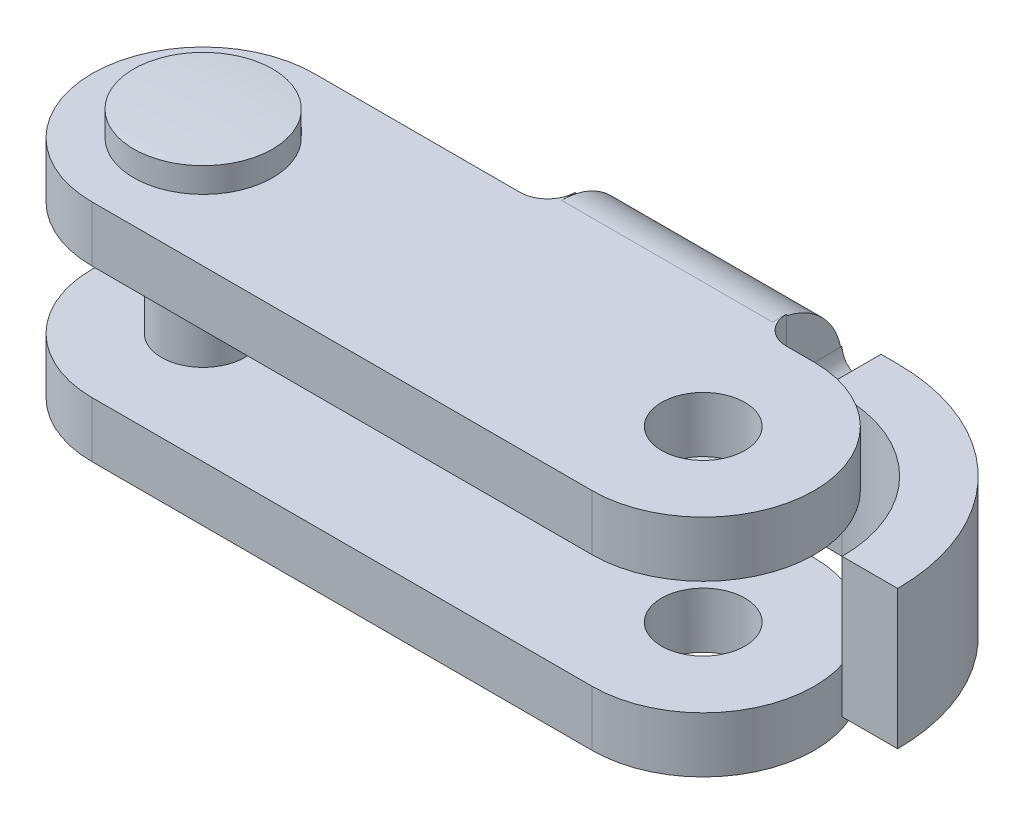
ISO-10303-21;
HEADER;
FILE_DESCRIPTION(('STEP AP214'),'2;1');
FILE_NAME('part.step','',(''),(''),'','','');
FILE_SCHEMA(('AUTOMOTIVE_DESIGN { 1 0 10303 214 1 1 1 1 }'));
ENDSEC;
DATA;
#1=APPLICATION_CONTEXT('core data for automotive mechanical design processes');
#2=APPLICATION_PROTOCOL_DEFINITION('international standard','automotive_design',2000,#1);
#3=PRODUCT_CONTEXT('',#1,'mechanical');
#4=PRODUCT('Part','Part','',(#3));
#5=PRODUCT_RELATED_PRODUCT_CATEGORY('part','',(#4));
#6=PRODUCT_DEFINITION_FORMATION('','',#4);
#7=PRODUCT_DEFINITION_CONTEXT('part definition',#1,'design');
#8=PRODUCT_DEFINITION('design','',#6,#7);
#9=PRODUCT_DEFINITION_SHAPE('','',#8);
#10=(LENGTH_UNIT() NAMED_UNIT(*) SI_UNIT(.MILLI.,.METRE.));
#11=(NAMED_UNIT(*) PLANE_ANGLE_UNIT() SI_UNIT($,.RADIAN.));
#12=(NAMED_UNIT(*) SI_UNIT($,.STERADIAN.) SOLID_ANGLE_UNIT());
#13=UNCERTAINTY_MEASURE_WITH_UNIT(LENGTH_MEASURE(1.E-05),#10,'distance_accuracy_value','');
#14=(GEOMETRIC_REPRESENTATION_CONTEXT(3) GLOBAL_UNCERTAINTY_ASSIGNED_CONTEXT((#13)) GLOBAL_UNIT_ASSIGNED_CONTEXT((#10,
#11,#12)) REPRESENTATION_CONTEXT('',''));
#15=CARTESIAN_POINT('',(0.,0.,0.));
#16=DIRECTION('',(0.,0.,1.));
#17=DIRECTION('',(1.,0.,0.));
#18=AXIS2_PLACEMENT_3D('',#15,#16,#17);
#19=CARTESIAN_POINT('',(0.,-3.55,0.));
#20=DIRECTION('',(0.,-1.,0.));
#21=DIRECTION('',(0.,0.,1.));
#22=AXIS2_PLACEMENT_3D('',#19,#20,#21);
#23=CONICAL_SURFACE('',#22,0.85,1.04719755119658);
#24=CARTESIAN_POINT('',(0.,-3.0592522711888,0.));
#25=VERTEX_POINT('',#24);
#26=VERTEX_LOOP('',#25);
#27=FACE_BOUND('',#26,.T.);
#28=CARTESIAN_POINT('',(0.,-3.55,0.));
#29=DIRECTION('',(0.,1.,0.));
#30=DIRECTION('',(0.,0.,-1.));
#31=AXIS2_PLACEMENT_3D('',#28,#29,#30);
#32=CIRCLE('',#31,0.85);
#33=CARTESIAN_POINT('',(0.,-3.55,-0.85));
#34=VERTEX_POINT('',#33);
#35=EDGE_CURVE('E446',#34,#34,#32,.T.);
#36=ORIENTED_EDGE('',*,*,#35,.F.);
#37=EDGE_LOOP('',(#36));
#38=FACE_BOUND('',#37,.T.);
#39=ADVANCED_FACE('F14',(#27,#38),#23,.F.);
#40=CARTESIAN_POINT('',(0.,-3.0592522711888,0.));
#41=DIRECTION('',(0.,1.,0.));
#42=DIRECTION('',(0.,0.,-1.));
#43=AXIS2_PLACEMENT_3D('',#40,#41,#42);
#44=CYLINDRICAL_SURFACE('',#43,0.85000000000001);
#45=ORIENTED_EDGE('',*,*,#35,.T.);
#46=EDGE_LOOP('',(#45));
#47=FACE_BOUND('',#46,.T.);
#48=CARTESIAN_POINT('',(0.,-5.0379559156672,0.));
#49=DIRECTION('',(0.,1.,0.));
#50=DIRECTION('',(0.,0.,-1.));
#51=AXIS2_PLACEMENT_3D('',#48,#49,#50);
#52=CIRCLE('',#51,0.85000000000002);
#53=CARTESIAN_POINT('',(-0.850000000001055,-5.0379559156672,0.));
#54=VERTEX_POINT('',#53);
#55=EDGE_CURVE('E1627',#54,#54,#52,.T.);
#56=ORIENTED_EDGE('',*,*,#55,.F.);
#57=EDGE_LOOP('',(#56));
#58=FACE_BOUND('',#57,.T.);
#59=ADVANCED_FACE('F1156',(#47,#58),#44,.F.);
#60=CARTESIAN_POINT('',(-5.37308912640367E-12,24.9499999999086,0.));
#61=DIRECTION('',(0.,1.,0.));
#62=DIRECTION('',(-1.,0.,0.));
#63=AXIS2_PLACEMENT_3D('',#60,#61,#62);
#64=SPHERICAL_SURFACE('',#63,29.9999999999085);
#65=CARTESIAN_POINT('',(0.,-4.9456518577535,0.));
#66=DIRECTION('',(0.,1.,0.));
#67=DIRECTION('',(0.,0.,-1.));
#68=AXIS2_PLACEMENT_3D('',#65,#66,#67);
#69=CIRCLE('',#68,2.5);
#70=CARTESIAN_POINT('',(-2.50000000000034,-4.9456518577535,0.));
#71=VERTEX_POINT('',#70);
#72=EDGE_CURVE('E1630',#71,#71,#69,.T.);
#73=CARTESIAN_POINT('',(-0.850000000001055,-5.0379559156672,0.));
#74=CARTESIAN_POINT('',(-0.867209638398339,-5.03746811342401,0.));
#75=CARTESIAN_POINT('',(-0.884418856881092,-5.03696549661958,0.));
#76=CARTESIAN_POINT('',(-0.918836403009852,-5.0359306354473,0.));
#77=CARTESIAN_POINT('',(-0.93604473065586,-5.03539839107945,0.));
#78=CARTESIAN_POINT('',(-0.97046044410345,-5.0343042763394,0.));
#79=CARTESIAN_POINT('',(-0.987667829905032,-5.0337424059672,0.));
#80=CARTESIAN_POINT('',(-1.02208160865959,-5.03258904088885,0.));
#81=CARTESIAN_POINT('',(-1.03928800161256,-5.03199754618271,0.));
#82=CARTESIAN_POINT('',(-1.07369974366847,-5.0307849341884,0.));
#83=CARTESIAN_POINT('',(-1.0909050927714,-5.03016381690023,0.));
#84=CARTESIAN_POINT('',(-1.12531469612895,-5.02889196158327,0.));
#85=CARTESIAN_POINT('',(-1.14251895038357,-5.02824122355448,0.));
#86=CARTESIAN_POINT('',(-1.17692631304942,-5.02691012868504,0.));
#87=CARTESIAN_POINT('',(-1.19412942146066,-5.02622977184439,0.));
#88=CARTESIAN_POINT('',(-1.22853444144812,-5.02483944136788,0.));
#89=CARTESIAN_POINT('',(-1.24573635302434,-5.02412946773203,0.));
#90=CARTESIAN_POINT('',(-1.28013892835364,-5.02267990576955,0.));
#91=CARTESIAN_POINT('',(-1.29733959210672,-5.02194031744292,0.));
#92=CARTESIAN_POINT('',(-1.33173962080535,-5.0204315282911,0.));
#93=CARTESIAN_POINT('',(-1.3489389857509,-5.01966232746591,0.));
#94=CARTESIAN_POINT('',(-1.3833363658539,-5.01809431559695,0.));
#95=CARTESIAN_POINT('',(-1.40053438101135,-5.01729550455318,0.));
#96=CARTESIAN_POINT('',(-1.4349290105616,-5.01566827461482,0.));
#97=CARTESIAN_POINT('',(-1.45212562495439,-5.01483985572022,0.));
#98=CARTESIAN_POINT('',(-1.48651740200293,-5.01315341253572,0.));
#99=CARTESIAN_POINT('',(-1.50371256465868,-5.01229538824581,0.));
#100=CARTESIAN_POINT('',(-1.53810138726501,-5.01054973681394,0.));
#101=CARTESIAN_POINT('',(-1.5552950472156,-5.00966210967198,0.));
#102=CARTESIAN_POINT('',(-1.58968081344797,-5.00785725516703,0.));
#103=CARTESIAN_POINT('',(-1.60687291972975,-5.00694002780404,0.));
#104=CARTESIAN_POINT('',(-1.64125552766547,-5.00507597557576,0.));
#105=CARTESIAN_POINT('',(-1.65844602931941,-5.00412915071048,0.));
#106=CARTESIAN_POINT('',(-1.69282537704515,-5.0022059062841,0.));
#107=CARTESIAN_POINT('',(-1.71001422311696,-5.00122948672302,0.));
#108=CARTESIAN_POINT('',(-1.74439020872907,-4.99924705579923,0.));
#109=CARTESIAN_POINT('',(-1.76157734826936,-4.99824104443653,0.));
#110=CARTESIAN_POINT('',(-1.79594986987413,-4.99619943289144,0.));
#111=CARTESIAN_POINT('',(-1.8131352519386,-4.99516383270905,0.));
#112=CARTESIAN_POINT('',(-1.8475042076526,-4.99306304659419,0.));
#113=CARTESIAN_POINT('',(-1.86468778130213,-4.99199786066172,0.));
#114=CARTESIAN_POINT('',(-1.8990530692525,-4.98983790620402,0.));
#115=CARTESIAN_POINT('',(-1.91623478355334,-4.98874313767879,0.));
#116=CARTESIAN_POINT('',(-1.95059630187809,-4.98652402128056,0.));
#117=CARTESIAN_POINT('',(-1.967776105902,-4.98539967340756,0.));
#118=CARTESIAN_POINT('',(-2.00213375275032,-4.98312140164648,0.));
#119=CARTESIAN_POINT('',(-2.01931159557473,-4.98196747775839,0.));
#120=CARTESIAN_POINT('',(-2.05366526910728,-4.97963005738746,0.));
#121=CARTESIAN_POINT('',(-2.07084109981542,-4.97844656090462,0.));
#122=CARTESIAN_POINT('',(-2.10519069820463,-4.97604999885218,0.));
#123=CARTESIAN_POINT('',(-2.1223644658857,-4.97483693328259,0.));
#124=CARTESIAN_POINT('',(-2.15670988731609,-4.97238123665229,0.));
#125=CARTESIAN_POINT('',(-2.17388154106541,-4.97113860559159,0.));
#126=CARTESIAN_POINT('',(-2.20822268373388,-4.96862378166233,0.));
#127=CARTESIAN_POINT('',(-2.22539217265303,-4.96735158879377,0.));
#128=CARTESIAN_POINT('',(-2.25972893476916,-4.9647776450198,0.));
#129=CARTESIAN_POINT('',(-2.27689620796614,-4.96347589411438,0.));
#130=CARTESIAN_POINT('',(-2.31122848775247,-4.96084283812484,0.));
#131=CARTESIAN_POINT('',(-2.32839349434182,-4.95951153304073,0.));
#132=CARTESIAN_POINT('',(-2.36272119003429,-4.95681937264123,0.));
#133=CARTESIAN_POINT('',(-2.37988387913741,-4.95545851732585,0.));
#134=CARTESIAN_POINT('',(-2.41420688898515,-4.95270726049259,0.));
#135=CARTESIAN_POINT('',(-2.43136720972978,-4.9513168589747,0.));
#136=CARTESIAN_POINT('',(-2.46568543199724,-4.94850651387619,0.));
#137=CARTESIAN_POINT('',(-2.48284333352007,-4.94708657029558,0.));
#138=CARTESIAN_POINT('',(-2.50000000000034,-4.9456518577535,0.));
#139=B_SPLINE_CURVE_WITH_KNOTS('',3,(#73,#74,#75,#76,#77,#78,#79,#80,#81,#82,#83,#84,#85,#86,
#87,#88,#89,#90,#91,#92,#93,#94,#95,#96,#97,#98,#99,#100,#101,#102,#103,#104,#105,#106,#107,
#108,#109,#110,#111,#112,#113,#114,#115,#116,#117,#118,#119,#120,#121,#122,#123,#124,#125,#126,
#127,#128,#129,#130,#131,#132,#133,#134,#135,#136,#137,#138),.UNSPECIFIED.,.F.,.F.,(4,2,2,2,2,2,
2,2,2,2,2,2,2,2,2,2,2,2,2,2,2,2,2,2,2,2,2,2,2,2,2,2,4),(0.,0.0516496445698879,0.103299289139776,
0.154948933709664,0.206598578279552,0.258248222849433,0.309897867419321,0.361547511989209,
0.413197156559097,0.464846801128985,0.516496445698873,0.568146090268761,0.619795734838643,
0.671445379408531,0.723095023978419,0.774744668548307,0.826394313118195,0.878043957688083,
0.929693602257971,0.981343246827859,1.03299289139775,1.08464253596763,1.13629218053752,
1.1879418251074,1.23959146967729,1.29124111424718,1.34289075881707,1.39454040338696,
1.44619004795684,1.49783969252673,1.54948933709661,1.6011389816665,1.65278862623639),.UNSPECIFIED.);
#140=EDGE_CURVE('BSEAM1147',#54,#71,#139,.T.);
#141=ORIENTED_EDGE('',*,*,#55,.T.);
#142=ORIENTED_EDGE('',*,*,#72,.F.);
#143=ORIENTED_EDGE('',*,*,#140,.T.);
#144=ORIENTED_EDGE('',*,*,#140,.F.);
#145=EDGE_LOOP('',(#141,#143,#142,#144));
#146=FACE_BOUND('',#145,.T.);
#147=ADVANCED_FACE('F1147',(#146),#64,.T.);
#148=CARTESIAN_POINT('',(0.,-3.0592522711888,0.));
#149=DIRECTION('',(0.,1.,0.));
#150=DIRECTION('',(0.,0.,-1.));
#151=AXIS2_PLACEMENT_3D('',#148,#149,#150);
#152=CYLINDRICAL_SURFACE('',#151,2.5);
#153=ORIENTED_EDGE('',*,*,#72,.T.);
#154=EDGE_LOOP('',(#153));
#155=FACE_BOUND('',#154,.T.);
#156=CARTESIAN_POINT('',(0.,-4.05,0.));
#157=DIRECTION('',(0.,1.,0.));
#158=DIRECTION('',(0.,0.,-1.));
#159=AXIS2_PLACEMENT_3D('',#156,#157,#158);
#160=CIRCLE('',#159,2.5);
#161=CARTESIAN_POINT('',(0.,-4.05,-2.5));
#162=VERTEX_POINT('',#161);
#163=EDGE_CURVE('E1635',#162,#162,#160,.T.);
#164=ORIENTED_EDGE('',*,*,#163,.F.);
#165=EDGE_LOOP('',(#164));
#166=FACE_BOUND('',#165,.T.);
#167=ADVANCED_FACE('F1139',(#155,#166),#152,.T.);
#168=CARTESIAN_POINT('',(0.,-3.0592522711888,0.));
#169=DIRECTION('',(0.,1.,0.));
#170=DIRECTION('',(0.,0.,-1.));
#171=AXIS2_PLACEMENT_3D('',#168,#169,#170);
#172=CYLINDRICAL_SURFACE('',#171,1.5);
#173=CARTESIAN_POINT('',(0.,2.05,0.));
#174=DIRECTION('',(0.,-1.,0.));
#175=DIRECTION('',(1.,0.,0.));
#176=AXIS2_PLACEMENT_3D('',#173,#174,#175);
#177=CIRCLE('',#176,1.5);
#178=CARTESIAN_POINT('',(1.5,2.05,0.));
#179=VERTEX_POINT('',#178);
#180=EDGE_CURVE('E24',#179,#179,#177,.F.);
#181=ORIENTED_EDGE('',*,*,#180,.F.);
#182=EDGE_LOOP('',(#181));
#183=FACE_BOUND('',#182,.T.);
#184=CARTESIAN_POINT('',(0.,-2.05,0.));
#185=DIRECTION('',(0.,1.,0.));
#186=DIRECTION('',(-1.,0.,0.));
#187=AXIS2_PLACEMENT_3D('',#184,#185,#186);
#188=CIRCLE('',#187,1.5);
#189=CARTESIAN_POINT('',(-1.5,-2.05,0.));
#190=VERTEX_POINT('',#189);
#191=EDGE_CURVE('E9',#190,#190,#188,.T.);
#192=ORIENTED_EDGE('',*,*,#191,.T.);
#193=EDGE_LOOP('',(#192));
#194=FACE_BOUND('',#193,.T.);
#195=ADVANCED_FACE('F1132',(#183,#194),#172,.T.);
#196=CARTESIAN_POINT('',(-1.49728320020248E-12,-24.9499999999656,0.));
#197=DIRECTION('',(0.,1.,0.));
#198=DIRECTION('',(1.,0.,0.));
#199=AXIS2_PLACEMENT_3D('',#196,#197,#198);
#200=SPHERICAL_SURFACE('',#199,29.9999999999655);
#201=CARTESIAN_POINT('',(0.,4.9456518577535,0.));
#202=DIRECTION('',(0.,1.,0.));
#203=DIRECTION('',(0.,0.,-1.));
#204=AXIS2_PLACEMENT_3D('',#201,#202,#203);
#205=CIRCLE('',#204,2.5);
#206=CARTESIAN_POINT('',(0.,4.9456518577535,-2.5));
#207=VERTEX_POINT('',#206);
#208=EDGE_CURVE('E449',#207,#207,#205,.T.);
#209=ORIENTED_EDGE('',*,*,#208,.T.);
#210=EDGE_LOOP('',(#209));
#211=FACE_BOUND('',#210,.T.);
#212=ADVANCED_FACE('F1123',(#211),#200,.T.);
#213=CARTESIAN_POINT('',(0.,-3.0592522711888,0.));
#214=DIRECTION('',(0.,1.,0.));
#215=DIRECTION('',(0.,0.,-1.));
#216=AXIS2_PLACEMENT_3D('',#213,#214,#215);
#217=CYLINDRICAL_SURFACE('',#216,2.5);
#218=CARTESIAN_POINT('',(0.,4.05,0.));
#219=DIRECTION('',(0.,1.,0.));
#220=DIRECTION('',(0.,0.,-1.));
#221=AXIS2_PLACEMENT_3D('',#218,#219,#220);
#222=CIRCLE('',#221,2.5);
#223=CARTESIAN_POINT('',(0.,4.05,-2.5));
#224=VERTEX_POINT('',#223);
#225=EDGE_CURVE('E1638',#224,#224,#222,.T.);
#226=ORIENTED_EDGE('',*,*,#225,.T.);
#227=EDGE_LOOP('',(#226));
#228=FACE_BOUND('',#227,.T.);
#229=ORIENTED_EDGE('',*,*,#208,.F.);
#230=EDGE_LOOP('',(#229));
#231=FACE_BOUND('',#230,.T.);
#232=ADVANCED_FACE('F835',(#228,#231),#217,.T.);
#233=CARTESIAN_POINT('',(23.,-2.5,0.));
#234=DIRECTION('',(0.,0.,1.));
#235=DIRECTION('',(0.,-1.,0.));
#236=AXIS2_PLACEMENT_3D('',#233,#234,#235);
#237=PLANE('',#236);
#238=DIRECTION('',(0.,1.,0.));
#239=VECTOR('',#238,1.);
#240=CARTESIAN_POINT('',(25.,-2.5,0.));
#241=LINE('',#240,#239);
#242=CARTESIAN_POINT('',(25.,-2.5,0.));
#243=VERTEX_POINT('',#242);
#244=CARTESIAN_POINT('',(25.,2.5,0.));
#245=VERTEX_POINT('',#244);
#246=EDGE_CURVE('E345',#243,#245,#241,.T.);
#247=ORIENTED_EDGE('',*,*,#246,.T.);
#248=DIRECTION('',(1.,0.,0.));
#249=VECTOR('',#248,1.);
#250=CARTESIAN_POINT('',(23.,2.5,0.));
#251=LINE('',#250,#249);
#252=CARTESIAN_POINT('',(23.,2.5,0.));
#253=VERTEX_POINT('',#252);
#254=EDGE_CURVE('E321',#253,#245,#251,.T.);
#255=ORIENTED_EDGE('',*,*,#254,.F.);
#256=DIRECTION('',(0.,1.,0.));
#257=VECTOR('',#256,1.);
#258=CARTESIAN_POINT('',(23.,-2.5,0.));
#259=LINE('',#258,#257);
#260=CARTESIAN_POINT('',(23.,-2.5,0.));
#261=VERTEX_POINT('',#260);
#262=EDGE_CURVE('E347',#261,#253,#259,.T.);
#263=ORIENTED_EDGE('',*,*,#262,.F.);
#264=DIRECTION('',(1.,0.,0.));
#265=VECTOR('',#264,1.);
#266=CARTESIAN_POINT('',(23.,-2.5,0.));
#267=LINE('',#266,#265);
#268=EDGE_CURVE('E335',#261,#243,#267,.T.);
#269=ORIENTED_EDGE('',*,*,#268,.T.);
#270=EDGE_LOOP('',(#247,#255,#263,#269));
#271=FACE_BOUND('',#270,.T.);
#272=ADVANCED_FACE('F756',(#271),#237,.T.);
#273=CARTESIAN_POINT('',(18.0000000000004,-2.5,-3.87927537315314E-13));
#274=DIRECTION('',(0.,1.,0.));
#275=DIRECTION('',(0.,0.,1.));
#276=AXIS2_PLACEMENT_3D('',#273,#274,#275);
#277=CYLINDRICAL_SURFACE('',#276,4.99999999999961);
#278=ORIENTED_EDGE('',*,*,#262,.T.);
#279=CARTESIAN_POINT('',(18.0000000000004,2.5,-3.87927537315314E-13));
#280=DIRECTION('',(0.,-1.,0.));
#281=DIRECTION('',(0.,0.,1.));
#282=AXIS2_PLACEMENT_3D('',#279,#280,#281);
#283=CIRCLE('',#282,4.99999999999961);
#284=CARTESIAN_POINT('',(18.,2.5,-5.));
#285=VERTEX_POINT('',#284);
#286=EDGE_CURVE('E318',#285,#253,#283,.T.);
#287=ORIENTED_EDGE('',*,*,#286,.F.);
#288=DIRECTION('',(0.,1.,0.));
#289=VECTOR('',#288,1.);
#290=CARTESIAN_POINT('',(18.,-2.5,-5.));
#291=LINE('',#290,#289);
#292=CARTESIAN_POINT('',(18.,-2.5,-5.));
#293=VERTEX_POINT('',#292);
#294=EDGE_CURVE('E349',#293,#285,#291,.T.);
#295=ORIENTED_EDGE('',*,*,#294,.F.);
#296=CARTESIAN_POINT('',(18.0000000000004,-2.5,-3.87927537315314E-13));
#297=DIRECTION('',(0.,-1.,0.));
#298=DIRECTION('',(0.,0.,1.));
#299=AXIS2_PLACEMENT_3D('',#296,#297,#298);
#300=CIRCLE('',#299,4.99999999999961);
#301=EDGE_CURVE('E332',#293,#261,#300,.T.);
#302=ORIENTED_EDGE('',*,*,#301,.T.);
#303=EDGE_LOOP('',(#278,#287,#295,#302));
#304=FACE_BOUND('',#303,.T.);
#305=ADVANCED_FACE('F627',(#304),#277,.F.);
#306=CARTESIAN_POINT('',(18.0000000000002,-2.5,-2.26815094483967E-13));
#307=DIRECTION('',(0.,1.,0.));
#308=DIRECTION('',(0.,0.,1.));
#309=AXIS2_PLACEMENT_3D('',#306,#307,#308);
#310=CYLINDRICAL_SURFACE('',#309,6.99999999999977);
#311=DIRECTION('',(0.,1.,0.));
#312=VECTOR('',#311,1.);
#313=CARTESIAN_POINT('',(18.,-2.5,-7.));
#314=LINE('',#313,#312);
#315=CARTESIAN_POINT('',(18.,-2.5,-7.));
#316=VERTEX_POINT('',#315);
#317=CARTESIAN_POINT('',(18.,2.5,-7.));
#318=VERTEX_POINT('',#317);
#319=EDGE_CURVE('E341',#316,#318,#314,.T.);
#320=ORIENTED_EDGE('',*,*,#319,.T.);
#321=CARTESIAN_POINT('',(18.0000000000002,2.5,-2.26815094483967E-13));
#322=DIRECTION('',(0.,1.,0.));
#323=DIRECTION('',(0.,0.,1.));
#324=AXIS2_PLACEMENT_3D('',#321,#322,#323);
#325=CIRCLE('',#324,6.99999999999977);
#326=EDGE_CURVE('E324',#245,#318,#325,.T.);
#327=ORIENTED_EDGE('',*,*,#326,.F.);
#328=ORIENTED_EDGE('',*,*,#246,.F.);
#329=CARTESIAN_POINT('',(18.0000000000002,-2.5,-2.26815094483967E-13));
#330=DIRECTION('',(0.,1.,0.));
#331=DIRECTION('',(0.,0.,1.));
#332=AXIS2_PLACEMENT_3D('',#329,#330,#331);
#333=CIRCLE('',#332,6.99999999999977);
#334=EDGE_CURVE('E338',#243,#316,#333,.T.);
#335=ORIENTED_EDGE('',*,*,#334,.T.);
#336=EDGE_LOOP('',(#320,#327,#328,#335));
#337=FACE_BOUND('',#336,.T.);
#338=ADVANCED_FACE('F650',(#337),#310,.T.);
#339=CARTESIAN_POINT('',(18.0000000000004,2.5,-3.87927537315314E-13));
#340=DIRECTION('',(0.,-1.,0.));
#341=DIRECTION('',(0.,0.,-1.));
#342=AXIS2_PLACEMENT_3D('',#339,#340,#341);
#343=PLANE('',#342);
#344=DIRECTION('',(0.,0.,-1.));
#345=VECTOR('',#344,1.);
#346=CARTESIAN_POINT('',(17.4,2.5,-3.87927537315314E-13));
#347=LINE('',#346,#345);
#348=CARTESIAN_POINT('',(17.4,2.5,-5.));
#349=VERTEX_POINT('',#348);
#350=CARTESIAN_POINT('',(17.4,2.5,-7.));
#351=VERTEX_POINT('',#350);
#352=EDGE_CURVE('E439',#349,#351,#347,.T.);
#353=ORIENTED_EDGE('',*,*,#352,.F.);
#354=DIRECTION('',(1.,0.,0.));
#355=VECTOR('',#354,1.);
#356=CARTESIAN_POINT('',(16.,2.5,-5.));
#357=LINE('',#356,#355);
#358=EDGE_CURVE('E316',#349,#285,#357,.T.);
#359=ORIENTED_EDGE('',*,*,#358,.T.);
#360=ORIENTED_EDGE('',*,*,#286,.T.);
#361=ORIENTED_EDGE('',*,*,#254,.T.);
#362=ORIENTED_EDGE('',*,*,#326,.T.);
#363=DIRECTION('',(-1.,0.,0.));
#364=VECTOR('',#363,1.);
#365=CARTESIAN_POINT('',(18.,2.5,-7.));
#366=LINE('',#365,#364);
#367=EDGE_CURVE('E315',#318,#351,#366,.T.);
#368=ORIENTED_EDGE('',*,*,#367,.T.);
#369=EDGE_LOOP('',(#353,#359,#360,#361,#362,#368));
#370=FACE_BOUND('',#369,.T.);
#371=ADVANCED_FACE('F644',(#370),#343,.F.);
#372=CARTESIAN_POINT('',(17.4,2.05,-5.));
#373=DIRECTION('',(-1.,0.,0.));
#374=DIRECTION('',(0.,-1.,0.));
#375=AXIS2_PLACEMENT_3D('',#372,#373,#374);
#376=PLANE('',#375);
#377=ORIENTED_EDGE('',*,*,#352,.T.);
#378=DIRECTION('',(0.,1.,0.));
#379=VECTOR('',#378,1.);
#380=CARTESIAN_POINT('',(17.4,2.05,-7.));
#381=LINE('',#380,#379);
#382=CARTESIAN_POINT('',(17.4,2.05,-7.));
#383=VERTEX_POINT('',#382);
#384=EDGE_CURVE('E484',#383,#351,#381,.T.);
#385=ORIENTED_EDGE('',*,*,#384,.F.);
#386=DIRECTION('',(0.,0.,-1.));
#387=VECTOR('',#386,1.);
#388=CARTESIAN_POINT('',(17.4,2.05,-5.));
#389=LINE('',#388,#387);
#390=CARTESIAN_POINT('',(17.4,2.05,-5.));
#391=VERTEX_POINT('',#390);
#392=EDGE_CURVE('E266',#391,#383,#389,.T.);
#393=ORIENTED_EDGE('',*,*,#392,.F.);
#394=DIRECTION('',(0.,1.,0.));
#395=VECTOR('',#394,1.);
#396=CARTESIAN_POINT('',(17.4,2.05,-5.));
#397=LINE('',#396,#395);
#398=EDGE_CURVE('E490',#391,#349,#397,.T.);
#399=ORIENTED_EDGE('',*,*,#398,.T.);
#400=EDGE_LOOP('',(#377,#385,#393,#399));
#401=FACE_BOUND('',#400,.T.);
#402=ADVANCED_FACE('F542',(#401),#376,.T.);
#403=CARTESIAN_POINT('',(16.7,2.05,-5.));
#404=DIRECTION('',(0.,0.,-1.));
#405=DIRECTION('',(0.,1.,0.));
#406=AXIS2_PLACEMENT_3D('',#403,#404,#405);
#407=CYLINDRICAL_SURFACE('',#406,0.7);
#408=CARTESIAN_POINT('',(16.7,2.05,-7.));
#409=DIRECTION('',(0.,0.,1.));
#410=DIRECTION('',(-1.,0.,0.));
#411=AXIS2_PLACEMENT_3D('',#408,#409,#410);
#412=CIRCLE('',#411,0.7);
#413=CARTESIAN_POINT('',(16.,2.05,-7.));
#414=VERTEX_POINT('',#413);
#415=EDGE_CURVE('E263',#414,#383,#412,.T.);
#416=ORIENTED_EDGE('',*,*,#415,.F.);
#417=DIRECTION('',(0.,0.,-1.));
#418=VECTOR('',#417,1.);
#419=CARTESIAN_POINT('',(16.,2.05,-5.));
#420=LINE('',#419,#418);
#421=CARTESIAN_POINT('',(16.,2.05,-6.9494897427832));
#422=VERTEX_POINT('',#421);
#423=EDGE_CURVE('E258',#422,#414,#420,.T.);
#424=ORIENTED_EDGE('',*,*,#423,.F.);
#425=CARTESIAN_POINT('',(16.,2.05,-5.));
#426=VERTEX_POINT('',#425);
#427=EDGE_CURVE('E251',#426,#422,#420,.T.);
#428=ORIENTED_EDGE('',*,*,#427,.F.);
#429=CARTESIAN_POINT('',(16.7,2.05,-5.));
#430=DIRECTION('',(0.,0.,1.));
#431=DIRECTION('',(-1.,0.,0.));
#432=AXIS2_PLACEMENT_3D('',#429,#430,#431);
#433=CIRCLE('',#432,0.7);
#434=EDGE_CURVE('E488',#426,#391,#433,.T.);
#435=ORIENTED_EDGE('',*,*,#434,.T.);
#436=ORIENTED_EDGE('',*,*,#392,.T.);
#437=EDGE_LOOP('',(#416,#424,#428,#435,#436));
#438=FACE_BOUND('',#437,.T.);
#439=ADVANCED_FACE('F261',(#438),#407,.F.);
#440=CARTESIAN_POINT('',(16.7,-2.05,-5.));
#441=DIRECTION('',(0.,0.,-1.));
#442=DIRECTION('',(0.,1.,0.));
#443=AXIS2_PLACEMENT_3D('',#440,#441,#442);
#444=CYLINDRICAL_SURFACE('',#443,0.7);
#445=CARTESIAN_POINT('',(16.7,-2.05,-7.));
#446=DIRECTION('',(0.,0.,1.));
#447=DIRECTION('',(1.,0.,0.));
#448=AXIS2_PLACEMENT_3D('',#445,#446,#447);
#449=CIRCLE('',#448,0.7);
#450=CARTESIAN_POINT('',(17.4,-2.05,-7.));
#451=VERTEX_POINT('',#450);
#452=CARTESIAN_POINT('',(16.,-2.05,-7.));
#453=VERTEX_POINT('',#452);
#454=EDGE_CURVE('E458',#451,#453,#449,.T.);
#455=ORIENTED_EDGE('',*,*,#454,.F.);
#456=DIRECTION('',(0.,0.,-1.));
#457=VECTOR('',#456,1.);
#458=CARTESIAN_POINT('',(17.4,-2.05,-5.));
#459=LINE('',#458,#457);
#460=CARTESIAN_POINT('',(17.4,-2.05,-5.));
#461=VERTEX_POINT('',#460);
#462=EDGE_CURVE('E479',#461,#451,#459,.T.);
#463=ORIENTED_EDGE('',*,*,#462,.F.);
#464=CARTESIAN_POINT('',(16.7,-2.05,-5.));
#465=DIRECTION('',(0.,0.,1.));
#466=DIRECTION('',(1.,0.,0.));
#467=AXIS2_PLACEMENT_3D('',#464,#465,#466);
#468=CIRCLE('',#467,0.7);
#469=CARTESIAN_POINT('',(16.,-2.05,-5.));
#470=VERTEX_POINT('',#469);
#471=EDGE_CURVE('E473',#461,#470,#468,.T.);
#472=ORIENTED_EDGE('',*,*,#471,.T.);
#473=DIRECTION('',(0.,0.,-1.));
#474=VECTOR('',#473,1.);
#475=CARTESIAN_POINT('',(16.,-2.05,-5.));
#476=LINE('',#475,#474);
#477=CARTESIAN_POINT('',(16.,-2.05,-6.9494897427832));
#478=VERTEX_POINT('',#477);
#479=EDGE_CURVE('E475',#470,#478,#476,.T.);
#480=ORIENTED_EDGE('',*,*,#479,.T.);
#481=DIRECTION('',(0.,0.,-1.));
#482=VECTOR('',#481,1.);
#483=CARTESIAN_POINT('',(16.,-2.05,-5.));
#484=LINE('',#483,#482);
#485=EDGE_CURVE('E441',#453,#478,#484,.F.);
#486=ORIENTED_EDGE('',*,*,#485,.F.);
#487=EDGE_LOOP('',(#455,#463,#472,#480,#486));
#488=FACE_BOUND('',#487,.T.);
#489=ADVANCED_FACE('F618',(#488),#444,.F.);
#490=CARTESIAN_POINT('',(17.4,-3.5,-5.));
#491=DIRECTION('',(-1.,0.,0.));
#492=DIRECTION('',(0.,-1.,0.));
#493=AXIS2_PLACEMENT_3D('',#490,#491,#492);
#494=PLANE('',#493);
#495=DIRECTION('',(0.,1.,0.));
#496=VECTOR('',#495,1.);
#497=CARTESIAN_POINT('',(17.4,-3.5,-5.));
#498=LINE('',#497,#496);
#499=CARTESIAN_POINT('',(17.4,-2.5,-5.));
#500=VERTEX_POINT('',#499);
#501=EDGE_CURVE('E471',#500,#461,#498,.T.);
#502=ORIENTED_EDGE('',*,*,#501,.T.);
#503=ORIENTED_EDGE('',*,*,#462,.T.);
#504=DIRECTION('',(0.,1.,0.));
#505=VECTOR('',#504,1.);
#506=CARTESIAN_POINT('',(17.4,-3.5,-7.));
#507=LINE('',#506,#505);
#508=CARTESIAN_POINT('',(17.4,-2.5,-7.));
#509=VERTEX_POINT('',#508);
#510=EDGE_CURVE('E452',#509,#451,#507,.T.);
#511=ORIENTED_EDGE('',*,*,#510,.F.);
#512=DIRECTION('',(0.,0.,-1.));
#513=VECTOR('',#512,1.);
#514=CARTESIAN_POINT('',(17.4,-2.5,-3.87927537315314E-13));
#515=LINE('',#514,#513);
#516=EDGE_CURVE('E444',#500,#509,#515,.T.);
#517=ORIENTED_EDGE('',*,*,#516,.F.);
#518=EDGE_LOOP('',(#502,#503,#511,#517));
#519=FACE_BOUND('',#518,.T.);
#520=ADVANCED_FACE('F633',(#519),#494,.T.);
#521=CARTESIAN_POINT('',(18.0000000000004,-2.5,-3.87927537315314E-13));
#522=DIRECTION('',(0.,-1.,0.));
#523=DIRECTION('',(0.,0.,-1.));
#524=AXIS2_PLACEMENT_3D('',#521,#522,#523);
#525=PLANE('',#524);
#526=DIRECTION('',(1.,0.,0.));
#527=VECTOR('',#526,1.);
#528=CARTESIAN_POINT('',(16.,-2.5,-5.));
#529=LINE('',#528,#527);
#530=EDGE_CURVE('E330',#500,#293,#529,.T.);
#531=ORIENTED_EDGE('',*,*,#530,.F.);
#532=ORIENTED_EDGE('',*,*,#516,.T.);
#533=DIRECTION('',(-1.,0.,0.));
#534=VECTOR('',#533,1.);
#535=CARTESIAN_POINT('',(18.,-2.5,-7.));
#536=LINE('',#535,#534);
#537=EDGE_CURVE('E327',#316,#509,#536,.T.);
#538=ORIENTED_EDGE('',*,*,#537,.F.);
#539=ORIENTED_EDGE('',*,*,#334,.F.);
#540=ORIENTED_EDGE('',*,*,#268,.F.);
#541=ORIENTED_EDGE('',*,*,#301,.F.);
#542=EDGE_LOOP('',(#531,#532,#538,#539,#540,#541));
#543=FACE_BOUND('',#542,.T.);
#544=ADVANCED_FACE('F640',(#543),#525,.T.);
#545=CARTESIAN_POINT('',(16.,1.5500000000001,-4.50000000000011));
#546=DIRECTION('',(-1.,0.,0.));
#547=DIRECTION('',(0.,-1.,0.));
#548=AXIS2_PLACEMENT_3D('',#545,#546,#547);
#549=PLANE('',#548);
#550=ORIENTED_EDGE('',*,*,#423,.T.);
#551=DIRECTION('',(0.,1.,0.));
#552=VECTOR('',#551,1.);
#553=CARTESIAN_POINT('',(16.,-4.05,-7.));
#554=LINE('',#553,#552);
#555=CARTESIAN_POINT('',(16.,1.55,-7.));
#556=VERTEX_POINT('',#555);
#557=EDGE_CURVE('E268',#556,#414,#554,.T.);
#558=ORIENTED_EDGE('',*,*,#557,.F.);
#559=CARTESIAN_POINT('',(16.,1.5500000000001,-4.50000000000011));
#560=DIRECTION('',(-1.,0.,0.));
#561=DIRECTION('',(0.,0.,1.));
#562=AXIS2_PLACEMENT_3D('',#559,#560,#561);
#563=CIRCLE('',#562,2.4999999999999);
#564=EDGE_CURVE('E244',#422,#556,#563,.T.);
#565=ORIENTED_EDGE('',*,*,#564,.F.);
#566=EDGE_LOOP('',(#550,#558,#565));
#567=FACE_BOUND('',#566,.T.);
#568=ADVANCED_FACE('F267',(#567),#549,.T.);
#569=CARTESIAN_POINT('',(16.,-4.05,-5.));
#570=DIRECTION('',(1.,0.,0.));
#571=DIRECTION('',(0.,1.,0.));
#572=AXIS2_PLACEMENT_3D('',#569,#570,#571);
#573=PLANE('',#572);
#574=ORIENTED_EDGE('',*,*,#427,.T.);
#575=CARTESIAN_POINT('',(16.,3.99948974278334,-4.99999999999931));
#576=VERTEX_POINT('',#575);
#577=EDGE_CURVE('E239',#576,#422,#563,.T.);
#578=ORIENTED_EDGE('',*,*,#577,.F.);
#579=DIRECTION('',(0.,1.,0.));
#580=VECTOR('',#579,1.);
#581=CARTESIAN_POINT('',(16.,-4.05,-5.));
#582=LINE('',#581,#580);
#583=EDGE_CURVE('E254',#426,#576,#582,.T.);
#584=ORIENTED_EDGE('',*,*,#583,.F.);
#585=EDGE_LOOP('',(#574,#578,#584));
#586=FACE_BOUND('',#585,.T.);
#587=ADVANCED_FACE('F253',(#586),#573,.T.);
#588=CARTESIAN_POINT('',(16.,-2.5,-5.));
#589=DIRECTION('',(0.,0.,1.));
#590=DIRECTION('',(0.,-1.,0.));
#591=AXIS2_PLACEMENT_3D('',#588,#589,#590);
#592=PLANE('',#591);
#593=ORIENTED_EDGE('',*,*,#471,.F.);
#594=ORIENTED_EDGE('',*,*,#501,.F.);
#595=ORIENTED_EDGE('',*,*,#530,.T.);
#596=ORIENTED_EDGE('',*,*,#294,.T.);
#597=ORIENTED_EDGE('',*,*,#358,.F.);
#598=ORIENTED_EDGE('',*,*,#398,.F.);
#599=ORIENTED_EDGE('',*,*,#434,.F.);
#600=CARTESIAN_POINT('',(16.,1.55,-5.));
#601=VERTEX_POINT('',#600);
#602=EDGE_CURVE('E825',#601,#426,#582,.T.);
#603=ORIENTED_EDGE('',*,*,#602,.F.);
#604=DIRECTION('',(-1.,0.,0.));
#605=VECTOR('',#604,1.);
#606=CARTESIAN_POINT('',(17.,1.55,-5.));
#607=LINE('',#606,#605);
#608=CARTESIAN_POINT('',(8.4,1.55,-5.));
#609=VERTEX_POINT('',#608);
#610=EDGE_CURVE('E510',#601,#609,#607,.T.);
#611=ORIENTED_EDGE('',*,*,#610,.T.);
#612=DIRECTION('',(0.,1.,0.));
#613=VECTOR('',#612,1.);
#614=CARTESIAN_POINT('',(8.4,-4.05,-5.));
#615=LINE('',#614,#613);
#616=CARTESIAN_POINT('',(8.4,-1.55,-5.));
#617=VERTEX_POINT('',#616);
#618=EDGE_CURVE('E698',#617,#609,#615,.T.);
#619=ORIENTED_EDGE('',*,*,#618,.F.);
#620=DIRECTION('',(-1.,0.,0.));
#621=VECTOR('',#620,1.);
#622=CARTESIAN_POINT('',(17.,-1.55,-5.));
#623=LINE('',#622,#621);
#624=CARTESIAN_POINT('',(16.,-1.55,-5.));
#625=VERTEX_POINT('',#624);
#626=EDGE_CURVE('E500',#625,#617,#623,.T.);
#627=ORIENTED_EDGE('',*,*,#626,.F.);
#628=EDGE_CURVE('E399',#470,#625,#582,.T.);
#629=ORIENTED_EDGE('',*,*,#628,.F.);
#630=EDGE_LOOP('',(#593,#594,#595,#596,#597,#598,#599,#603,#611,#619,#627,#629));
#631=FACE_BOUND('',#630,.T.);
#632=ADVANCED_FACE('F599',(#631),#592,.T.);
#633=CARTESIAN_POINT('',(16.,-3.9994897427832,-5.));
#634=VERTEX_POINT('',#633);
#635=EDGE_CURVE('E398',#634,#470,#582,.T.);
#636=ORIENTED_EDGE('',*,*,#635,.F.);
#637=CARTESIAN_POINT('',(16.,-1.55000000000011,-4.50000000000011));
#638=DIRECTION('',(-1.,0.,0.));
#639=DIRECTION('',(0.,0.,1.));
#640=AXIS2_PLACEMENT_3D('',#637,#638,#639);
#641=CIRCLE('',#640,2.4999999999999);
#642=EDGE_CURVE('E278',#478,#634,#641,.T.);
#643=ORIENTED_EDGE('',*,*,#642,.F.);
#644=ORIENTED_EDGE('',*,*,#479,.F.);
#645=EDGE_LOOP('',(#636,#643,#644));
#646=FACE_BOUND('',#645,.T.);
#647=ADVANCED_FACE('F591',(#646),#573,.T.);
#648=CARTESIAN_POINT('',(16.,-1.55,-7.));
#649=VERTEX_POINT('',#648);
#650=EDGE_CURVE('E305',#453,#649,#554,.T.);
#651=ORIENTED_EDGE('',*,*,#650,.F.);
#652=ORIENTED_EDGE('',*,*,#485,.T.);
#653=EDGE_CURVE('E279',#649,#478,#641,.T.);
#654=ORIENTED_EDGE('',*,*,#653,.F.);
#655=EDGE_LOOP('',(#651,#652,#654));
#656=FACE_BOUND('',#655,.T.);
#657=ADVANCED_FACE('F597',(#656),#549,.T.);
#658=CARTESIAN_POINT('',(16.,-4.05,-7.));
#659=DIRECTION('',(0.,0.,-1.));
#660=DIRECTION('',(0.,1.,0.));
#661=AXIS2_PLACEMENT_3D('',#658,#659,#660);
#662=PLANE('',#661);
#663=ORIENTED_EDGE('',*,*,#537,.T.);
#664=ORIENTED_EDGE('',*,*,#510,.T.);
#665=ORIENTED_EDGE('',*,*,#454,.T.);
#666=ORIENTED_EDGE('',*,*,#650,.T.);
#667=DIRECTION('',(-1.,0.,0.));
#668=VECTOR('',#667,1.);
#669=CARTESIAN_POINT('',(16.,-1.55,-7.));
#670=LINE('',#669,#668);
#671=CARTESIAN_POINT('',(8.4,-1.55,-7.));
#672=VERTEX_POINT('',#671);
#673=EDGE_CURVE('E290',#649,#672,#670,.T.);
#674=ORIENTED_EDGE('',*,*,#673,.T.);
#675=DIRECTION('',(0.,1.,0.));
#676=VECTOR('',#675,1.);
#677=CARTESIAN_POINT('',(8.4,-4.05,-7.));
#678=LINE('',#677,#676);
#679=CARTESIAN_POINT('',(8.4,1.55,-7.));
#680=VERTEX_POINT('',#679);
#681=EDGE_CURVE('E426',#672,#680,#678,.T.);
#682=ORIENTED_EDGE('',*,*,#681,.T.);
#683=DIRECTION('',(-1.,0.,0.));
#684=VECTOR('',#683,1.);
#685=CARTESIAN_POINT('',(16.,1.55,-7.));
#686=LINE('',#685,#684);
#687=EDGE_CURVE('E294',#556,#680,#686,.T.);
#688=ORIENTED_EDGE('',*,*,#687,.F.);
#689=ORIENTED_EDGE('',*,*,#557,.T.);
#690=ORIENTED_EDGE('',*,*,#415,.T.);
#691=ORIENTED_EDGE('',*,*,#384,.T.);
#692=ORIENTED_EDGE('',*,*,#367,.F.);
#693=ORIENTED_EDGE('',*,*,#319,.F.);
#694=EDGE_LOOP('',(#663,#664,#665,#666,#674,#682,#688,#689,#690,#691,#692,#693));
#695=FACE_BOUND('',#694,.T.);
#696=ADVANCED_FACE('F16',(#695),#662,.T.);
#697=CARTESIAN_POINT('',(8.4,-4.05,-7.));
#698=DIRECTION('',(-1.,0.,0.));
#699=DIRECTION('',(0.,-1.,0.));
#700=AXIS2_PLACEMENT_3D('',#697,#698,#699);
#701=PLANE('',#700);
#702=DIRECTION('',(0.,1.,0.));
#703=VECTOR('',#702,1.);
#704=CARTESIAN_POINT('',(8.4,-4.05,-5.));
#705=LINE('',#704,#703);
#706=CARTESIAN_POINT('',(8.4,-3.99948974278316,-5.00000000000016));
#707=VERTEX_POINT('',#706);
#708=EDGE_CURVE('E427',#707,#617,#705,.T.);
#709=ORIENTED_EDGE('',*,*,#708,.T.);
#710=ORIENTED_EDGE('',*,*,#618,.T.);
#711=CARTESIAN_POINT('',(8.4,3.99948974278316,-5.00000000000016));
#712=VERTEX_POINT('',#711);
#713=EDGE_CURVE('E423',#609,#712,#705,.T.);
#714=ORIENTED_EDGE('',*,*,#713,.T.);
#715=CARTESIAN_POINT('',(8.4,1.5500000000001,-4.50000000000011));
#716=DIRECTION('',(-1.,0.,0.));
#717=DIRECTION('',(0.,0.,1.));
#718=AXIS2_PLACEMENT_3D('',#715,#716,#717);
#719=CIRCLE('',#718,2.4999999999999);
#720=EDGE_CURVE('E697',#712,#680,#719,.T.);
#721=ORIENTED_EDGE('',*,*,#720,.T.);
#722=ORIENTED_EDGE('',*,*,#681,.F.);
#723=CARTESIAN_POINT('',(8.4,-1.55000000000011,-4.50000000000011));
#724=DIRECTION('',(-1.,0.,0.));
#725=DIRECTION('',(0.,0.,1.));
#726=AXIS2_PLACEMENT_3D('',#723,#724,#725);
#727=CIRCLE('',#726,2.4999999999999);
#728=EDGE_CURVE('E270',#672,#707,#727,.T.);
#729=ORIENTED_EDGE('',*,*,#728,.T.);
#730=EDGE_LOOP('',(#709,#710,#714,#721,#722,#729));
#731=FACE_BOUND('',#730,.T.);
#732=ADVANCED_FACE('F539',(#731),#701,.T.);
#733=CARTESIAN_POINT('',(17.,-1.55000000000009,-4.50000000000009));
#734=DIRECTION('',(-1.,0.,0.));
#735=DIRECTION('',(0.,-1.,0.));
#736=AXIS2_PLACEMENT_3D('',#733,#734,#735);
#737=CYLINDRICAL_SURFACE('',#736,0.49999999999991);
#738=DIRECTION('',(-1.,0.,0.));
#739=VECTOR('',#738,1.);
#740=CARTESIAN_POINT('',(17.,-2.05,-4.5));
#741=LINE('',#740,#739);
#742=CARTESIAN_POINT('',(16.1339745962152,-2.05,-4.5));
#743=VERTEX_POINT('',#742);
#744=CARTESIAN_POINT('',(8.26602540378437,-2.05,-4.5));
#745=VERTEX_POINT('',#744);
#746=EDGE_CURVE('E504',#743,#745,#741,.T.);
#747=ORIENTED_EDGE('',*,*,#746,.F.);
#748=CARTESIAN_POINT('',(16.,-1.55,-5.));
#749=CARTESIAN_POINT('',(16.0000335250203,-1.5780590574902,-5.00002380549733));
#750=CARTESIAN_POINT('',(16.0000005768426,-1.606111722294,-4.99763946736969));
#751=CARTESIAN_POINT('',(16.0000493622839,-1.66141829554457,-4.98822751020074));
#752=CARTESIAN_POINT('',(16.0001310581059,-1.68867246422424,-4.98120142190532));
#753=CARTESIAN_POINT('',(16.0006566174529,-1.7416319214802,-4.96267304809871));
#754=CARTESIAN_POINT('',(16.00110070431,-1.76733624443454,-4.9511680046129));
#755=CARTESIAN_POINT('',(16.0027971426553,-1.81643338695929,-4.92402737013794));
#756=CARTESIAN_POINT('',(16.0040493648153,-1.83982657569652,-4.90839244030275));
#757=CARTESIAN_POINT('',(16.0078608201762,-1.88337981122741,-4.87366502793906));
#758=CARTESIAN_POINT('',(16.010406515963,-1.90357055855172,-4.85460965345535));
#759=CARTESIAN_POINT('',(16.0173036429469,-1.9403861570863,-4.81361815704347));
#760=CARTESIAN_POINT('',(16.021653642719,-1.9570138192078,-4.79168432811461));
#761=CARTESIAN_POINT('',(16.0323391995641,-1.98566425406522,-4.74673454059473));
#762=CARTESIAN_POINT('',(16.0385860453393,-1.99784786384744,-4.72379980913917));
#763=CARTESIAN_POINT('',(16.0533116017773,-2.01835595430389,-4.6769127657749));
#764=CARTESIAN_POINT('',(16.0617925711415,-2.0266765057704,-4.65295944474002));
#765=CARTESIAN_POINT('',(16.0800891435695,-2.03889890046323,-4.60717397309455));
#766=CARTESIAN_POINT('',(16.0897082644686,-2.04313874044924,-4.5853509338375));
#767=CARTESIAN_POINT('',(16.1106197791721,-2.04869426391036,-4.54219230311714));
#768=CARTESIAN_POINT('',(16.1219085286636,-2.05001621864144,-4.5208557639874));
#769=CARTESIAN_POINT('',(16.1339745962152,-2.05,-4.5));
#770=B_SPLINE_CURVE_WITH_KNOTS('',3,(#748,#749,#750,#751,#752,#753,#754,#755,#756,#757,#758,
#759,#760,#761,#762,#763,#764,#765,#766,#767,#768,#769),.UNSPECIFIED.,.F.,.F.,(4,2,2,2,2,2,2,2,
2,2,4),(0.,0.0840671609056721,0.168106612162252,0.252197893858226,0.336275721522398,
0.419491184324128,0.502640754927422,0.582381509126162,0.662203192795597,0.734628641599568,
0.806898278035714),.UNSPECIFIED.);
#771=EDGE_CURVE('E513',#625,#743,#770,.T.);
#772=ORIENTED_EDGE('',*,*,#771,.F.);
#773=ORIENTED_EDGE('',*,*,#626,.T.);
#774=CARTESIAN_POINT('',(8.26602540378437,-2.05,-4.5));
#775=CARTESIAN_POINT('',(8.27996094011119,-2.05003399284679,-4.52405497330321));
#776=CARTESIAN_POINT('',(8.29284841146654,-2.04826322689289,-4.54877437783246));
#777=CARTESIAN_POINT('',(8.31636308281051,-2.04079859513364,-4.59872711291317));
#778=CARTESIAN_POINT('',(8.3269870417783,-2.03509915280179,-4.62396112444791));
#779=CARTESIAN_POINT('',(8.34580703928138,-2.01943078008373,-4.67415399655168));
#780=CARTESIAN_POINT('',(8.35399330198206,-2.00944504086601,-4.69911137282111));
#781=CARTESIAN_POINT('',(8.36794199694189,-1.98524951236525,-4.74756710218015));
#782=CARTESIAN_POINT('',(8.37370813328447,-1.97104623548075,-4.7710676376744));
#783=CARTESIAN_POINT('',(8.38285136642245,-1.93968545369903,-4.8143524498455));
#784=CARTESIAN_POINT('',(8.3863494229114,-1.92275190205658,-4.83427422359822));
#785=CARTESIAN_POINT('',(8.39186527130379,-1.885850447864,-4.87133381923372));
#786=CARTESIAN_POINT('',(8.39388212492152,-1.86588063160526,-4.88846987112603));
#787=CARTESIAN_POINT('',(8.39689465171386,-1.82310163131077,-4.91967620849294));
#788=CARTESIAN_POINT('',(8.39787298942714,-1.80025116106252,-4.93369145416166));
#789=CARTESIAN_POINT('',(8.39918666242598,-1.75259255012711,-4.95789845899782));
#790=CARTESIAN_POINT('',(8.39952198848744,-1.72778438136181,-4.96809016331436));
#791=CARTESIAN_POINT('',(8.39990621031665,-1.67775264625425,-4.98409053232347));
#792=CARTESIAN_POINT('',(8.39996473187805,-1.65257410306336,-4.99004027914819));
#793=CARTESIAN_POINT('',(8.3999995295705,-1.60159896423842,-4.99800357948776));
#794=CARTESIAN_POINT('',(8.39997579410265,-1.57580228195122,-5.00001657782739));
#795=CARTESIAN_POINT('',(8.4,-1.55,-5.));
#796=B_SPLINE_CURVE_WITH_KNOTS('',3,(#774,#775,#776,#777,#778,#779,#780,#781,#782,#783,#784,
#785,#786,#787,#788,#789,#790,#791,#792,#793,#794,#795),.UNSPECIFIED.,.F.,.F.,(4,2,2,2,2,2,2,2,
2,2,4),(0.,0.083392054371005,0.166902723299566,0.250743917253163,0.334456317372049,
0.413225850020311,0.492045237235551,0.572160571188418,0.652277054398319,0.729585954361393,
0.806905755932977),.UNSPECIFIED.);
#797=EDGE_CURVE('E522',#745,#617,#796,.T.);
#798=ORIENTED_EDGE('',*,*,#797,.F.);
#799=EDGE_LOOP('',(#747,#772,#773,#798));
#800=FACE_BOUND('',#799,.T.);
#801=ADVANCED_FACE('F533',(#800),#737,.F.);
#802=CARTESIAN_POINT('',(8.4,1.5500000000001,-4.50000000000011));
#803=DIRECTION('',(-1.,0.,0.));
#804=DIRECTION('',(0.,-1.,0.));
#805=AXIS2_PLACEMENT_3D('',#802,#803,#804);
#806=PLANE('',#805);
#807=CARTESIAN_POINT('',(8.4,-4.05,-5.00000000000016));
#808=VERTEX_POINT('',#807);
#809=EDGE_CURVE('E424',#808,#707,#705,.T.);
#810=ORIENTED_EDGE('',*,*,#809,.T.);
#811=CARTESIAN_POINT('',(8.4,-4.05,-4.5));
#812=VERTEX_POINT('',#811);
#813=EDGE_CURVE('E273',#707,#812,#727,.T.);
#814=ORIENTED_EDGE('',*,*,#813,.T.);
#815=DIRECTION('',(0.,0.,-1.));
#816=VECTOR('',#815,1.);
#817=CARTESIAN_POINT('',(8.4,-4.05,-5.00000000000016));
#818=LINE('',#817,#816);
#819=EDGE_CURVE('E303',#812,#808,#818,.T.);
#820=ORIENTED_EDGE('',*,*,#819,.T.);
#821=EDGE_LOOP('',(#810,#814,#820));
#822=FACE_BOUND('',#821,.T.);
#823=ADVANCED_FACE('F538',(#822),#806,.F.);
#824=CARTESIAN_POINT('',(7.39999999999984,-4.05,-5.00000000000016));
#825=DIRECTION('',(0.,1.,0.));
#826=DIRECTION('',(0.,0.,1.));
#827=AXIS2_PLACEMENT_3D('',#824,#825,#826);
#828=CYLINDRICAL_SURFACE('',#827,1.00000000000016);
#829=DIRECTION('',(0.,1.,0.));
#830=VECTOR('',#829,1.);
#831=CARTESIAN_POINT('',(7.39999999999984,-4.05,-4.));
#832=LINE('',#831,#830);
#833=CARTESIAN_POINT('',(7.39999999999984,-4.05,-4.));
#834=VERTEX_POINT('',#833);
#835=CARTESIAN_POINT('',(7.39999999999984,-2.05,-4.));
#836=VERTEX_POINT('',#835);
#837=EDGE_CURVE('E420',#834,#836,#832,.T.);
#838=ORIENTED_EDGE('',*,*,#837,.T.);
#839=CARTESIAN_POINT('',(7.39999999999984,-2.05,-5.00000000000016));
#840=DIRECTION('',(0.,1.,0.));
#841=DIRECTION('',(-1.,0.,0.));
#842=AXIS2_PLACEMENT_3D('',#839,#840,#841);
#843=CIRCLE('',#842,1.00000000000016);
#844=EDGE_CURVE('E803',#836,#745,#843,.T.);
#845=ORIENTED_EDGE('',*,*,#844,.T.);
#846=ORIENTED_EDGE('',*,*,#797,.T.);
#847=ORIENTED_EDGE('',*,*,#708,.F.);
#848=ORIENTED_EDGE('',*,*,#809,.F.);
#849=CARTESIAN_POINT('',(7.39999999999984,-4.05,-5.00000000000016));
#850=DIRECTION('',(0.,-1.,0.));
#851=DIRECTION('',(0.,0.,-1.));
#852=AXIS2_PLACEMENT_3D('',#849,#850,#851);
#853=CIRCLE('',#852,1.00000000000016);
#854=EDGE_CURVE('E373',#808,#834,#853,.T.);
#855=ORIENTED_EDGE('',*,*,#854,.T.);
#856=EDGE_LOOP('',(#838,#845,#846,#847,#848,#855));
#857=FACE_BOUND('',#856,.T.);
#858=ADVANCED_FACE('F585',(#857),#828,.F.);
#859=CARTESIAN_POINT('',(7.4,-4.05,-4.));
#860=DIRECTION('',(0.,0.,-1.));
#861=DIRECTION('',(0.,1.,0.));
#862=AXIS2_PLACEMENT_3D('',#859,#860,#861);
#863=PLANE('',#862);
#864=DIRECTION('',(0.,1.,0.));
#865=VECTOR('',#864,1.);
#866=CARTESIAN_POINT('',(0.,-4.05,-4.));
#867=LINE('',#866,#865);
#868=CARTESIAN_POINT('',(0.,-4.05,-4.));
#869=VERTEX_POINT('',#868);
#870=CARTESIAN_POINT('',(0.,-2.05,-4.));
#871=VERTEX_POINT('',#870);
#872=EDGE_CURVE('E416',#869,#871,#867,.T.);
#873=ORIENTED_EDGE('',*,*,#872,.T.);
#874=DIRECTION('',(1.,0.,0.));
#875=VECTOR('',#874,1.);
#876=CARTESIAN_POINT('',(7.4,-2.05,-4.));
#877=LINE('',#876,#875);
#878=EDGE_CURVE('E801',#871,#836,#877,.T.);
#879=ORIENTED_EDGE('',*,*,#878,.T.);
#880=ORIENTED_EDGE('',*,*,#837,.F.);
#881=DIRECTION('',(-1.,0.,0.));
#882=VECTOR('',#881,1.);
#883=CARTESIAN_POINT('',(7.4,-4.05,-4.));
#884=LINE('',#883,#882);
#885=EDGE_CURVE('E376',#834,#869,#884,.T.);
#886=ORIENTED_EDGE('',*,*,#885,.T.);
#887=EDGE_LOOP('',(#873,#879,#880,#886));
#888=FACE_BOUND('',#887,.T.);
#889=ADVANCED_FACE('F772',(#888),#863,.T.);
#890=CARTESIAN_POINT('',(0.,-4.05,0.));
#891=DIRECTION('',(0.,1.,0.));
#892=DIRECTION('',(0.,0.,1.));
#893=AXIS2_PLACEMENT_3D('',#890,#891,#892);
#894=CYLINDRICAL_SURFACE('',#893,4.);
#895=CARTESIAN_POINT('',(0.,-2.05,0.));
#896=DIRECTION('',(0.,1.,0.));
#897=DIRECTION('',(-1.,0.,0.));
#898=AXIS2_PLACEMENT_3D('',#895,#896,#897);
#899=CIRCLE('',#898,4.);
#900=CARTESIAN_POINT('',(0.,-2.05,4.));
#901=VERTEX_POINT('',#900);
#902=EDGE_CURVE('E798',#901,#871,#899,.F.);
#903=ORIENTED_EDGE('',*,*,#902,.T.);
#904=ORIENTED_EDGE('',*,*,#872,.F.);
#905=CARTESIAN_POINT('',(0.,-4.05,0.));
#906=DIRECTION('',(0.,1.,0.));
#907=DIRECTION('',(0.,0.,-1.));
#908=AXIS2_PLACEMENT_3D('',#905,#906,#907);
#909=CIRCLE('',#908,4.);
#910=CARTESIAN_POINT('',(0.,-4.05,4.));
#911=VERTEX_POINT('',#910);
#912=EDGE_CURVE('E379',#869,#911,#909,.T.);
#913=ORIENTED_EDGE('',*,*,#912,.T.);
#914=DIRECTION('',(0.,1.,0.));
#915=VECTOR('',#914,1.);
#916=CARTESIAN_POINT('',(0.,-4.05,4.));
#917=LINE('',#916,#915);
#918=EDGE_CURVE('E412',#911,#901,#917,.T.);
#919=ORIENTED_EDGE('',*,*,#918,.T.);
#920=EDGE_LOOP('',(#903,#904,#913,#919));
#921=FACE_BOUND('',#920,.T.);
#922=ADVANCED_FACE('F777',(#921),#894,.T.);
#923=CARTESIAN_POINT('',(0.,-4.05,4.));
#924=DIRECTION('',(0.,0.,1.));
#925=DIRECTION('',(0.,-1.,0.));
#926=AXIS2_PLACEMENT_3D('',#923,#924,#925);
#927=PLANE('',#926);
#928=DIRECTION('',(0.,1.,0.));
#929=VECTOR('',#928,1.);
#930=CARTESIAN_POINT('',(18.,-4.05,4.));
#931=LINE('',#930,#929);
#932=CARTESIAN_POINT('',(18.,-4.05,4.));
#933=VERTEX_POINT('',#932);
#934=CARTESIAN_POINT('',(18.,-2.05,4.));
#935=VERTEX_POINT('',#934);
#936=EDGE_CURVE('E408',#933,#935,#931,.T.);
#937=ORIENTED_EDGE('',*,*,#936,.T.);
#938=DIRECTION('',(-1.,0.,0.));
#939=VECTOR('',#938,1.);
#940=CARTESIAN_POINT('',(0.,-2.05,4.));
#941=LINE('',#940,#939);
#942=EDGE_CURVE('E578',#935,#901,#941,.T.);
#943=ORIENTED_EDGE('',*,*,#942,.T.);
#944=ORIENTED_EDGE('',*,*,#918,.F.);
#945=DIRECTION('',(1.,0.,0.));
#946=VECTOR('',#945,1.);
#947=CARTESIAN_POINT('',(0.,-4.05,4.));
#948=LINE('',#947,#946);
#949=EDGE_CURVE('E382',#911,#933,#948,.T.);
#950=ORIENTED_EDGE('',*,*,#949,.T.);
#951=EDGE_LOOP('',(#937,#943,#944,#950));
#952=FACE_BOUND('',#951,.T.);
#953=ADVANCED_FACE('F653',(#952),#927,.T.);
#954=CARTESIAN_POINT('',(18.,-4.05,0.));
#955=DIRECTION('',(0.,1.,0.));
#956=DIRECTION('',(0.,0.,1.));
#957=AXIS2_PLACEMENT_3D('',#954,#955,#956);
#958=CYLINDRICAL_SURFACE('',#957,4.);
#959=DIRECTION('',(0.,1.,0.));
#960=VECTOR('',#959,1.);
#961=CARTESIAN_POINT('',(18.,-4.05,-4.));
#962=LINE('',#961,#960);
#963=CARTESIAN_POINT('',(18.,-4.05,-4.));
#964=VERTEX_POINT('',#963);
#965=CARTESIAN_POINT('',(18.,-2.05,-4.));
#966=VERTEX_POINT('',#965);
#967=EDGE_CURVE('E404',#964,#966,#962,.T.);
#968=ORIENTED_EDGE('',*,*,#967,.T.);
#969=CARTESIAN_POINT('',(18.,-2.05,0.));
#970=DIRECTION('',(0.,1.,0.));
#971=DIRECTION('',(0.,0.,1.));
#972=AXIS2_PLACEMENT_3D('',#969,#970,#971);
#973=CIRCLE('',#972,4.);
#974=EDGE_CURVE('E498',#935,#966,#973,.T.);
#975=ORIENTED_EDGE('',*,*,#974,.F.);
#976=ORIENTED_EDGE('',*,*,#936,.F.);
#977=CARTESIAN_POINT('',(18.,-4.05,0.));
#978=DIRECTION('',(0.,1.,0.));
#979=DIRECTION('',(0.,0.,1.));
#980=AXIS2_PLACEMENT_3D('',#977,#978,#979);
#981=CIRCLE('',#980,4.);
#982=EDGE_CURVE('E385',#933,#964,#981,.T.);
#983=ORIENTED_EDGE('',*,*,#982,.T.);
#984=EDGE_LOOP('',(#968,#975,#976,#983));
#985=FACE_BOUND('',#984,.T.);
#986=ADVANCED_FACE('F795',(#985),#958,.T.);
#987=CARTESIAN_POINT('',(18.,-4.05,-4.));
#988=DIRECTION('',(0.,0.,-1.));
#989=DIRECTION('',(0.,1.,0.));
#990=AXIS2_PLACEMENT_3D('',#987,#988,#989);
#991=PLANE('',#990);
#992=DIRECTION('',(0.,1.,0.));
#993=VECTOR('',#992,1.);
#994=CARTESIAN_POINT('',(17.,-4.05,-4.));
#995=LINE('',#994,#993);
#996=CARTESIAN_POINT('',(17.,-4.05,-4.));
#997=VERTEX_POINT('',#996);
#998=CARTESIAN_POINT('',(17.,-2.05,-4.));
#999=VERTEX_POINT('',#998);
#1000=EDGE_CURVE('E400',#997,#999,#995,.T.);
#1001=ORIENTED_EDGE('',*,*,#1000,.T.);
#1002=DIRECTION('',(-1.,0.,0.));
#1003=VECTOR('',#1002,1.);
#1004=CARTESIAN_POINT('',(18.,-2.05,-4.));
#1005=LINE('',#1004,#1003);
#1006=EDGE_CURVE('E496',#966,#999,#1005,.T.);
#1007=ORIENTED_EDGE('',*,*,#1006,.F.);
#1008=ORIENTED_EDGE('',*,*,#967,.F.);
#1009=DIRECTION('',(-1.,0.,0.));
#1010=VECTOR('',#1009,1.);
#1011=CARTESIAN_POINT('',(18.,-4.05,-4.));
#1012=LINE('',#1011,#1010);
#1013=EDGE_CURVE('E388',#964,#997,#1012,.T.);
#1014=ORIENTED_EDGE('',*,*,#1013,.T.);
#1015=EDGE_LOOP('',(#1001,#1007,#1008,#1014));
#1016=FACE_BOUND('',#1015,.T.);
#1017=ADVANCED_FACE('F586',(#1016),#991,.T.);
#1018=CARTESIAN_POINT('',(16.9999999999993,-4.05,-4.99999999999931));
#1019=DIRECTION('',(0.,1.,0.));
#1020=DIRECTION('',(0.,0.,1.));
#1021=AXIS2_PLACEMENT_3D('',#1018,#1019,#1020);
#1022=CYLINDRICAL_SURFACE('',#1021,0.999999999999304);
#1023=ORIENTED_EDGE('',*,*,#771,.T.);
#1024=CARTESIAN_POINT('',(16.9999999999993,-2.05,-4.99999999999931));
#1025=DIRECTION('',(0.,1.,0.));
#1026=DIRECTION('',(-1.,0.,0.));
#1027=AXIS2_PLACEMENT_3D('',#1024,#1025,#1026);
#1028=CIRCLE('',#1027,0.999999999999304);
#1029=EDGE_CURVE('E433',#743,#999,#1028,.T.);
#1030=ORIENTED_EDGE('',*,*,#1029,.T.);
#1031=ORIENTED_EDGE('',*,*,#1000,.F.);
#1032=CARTESIAN_POINT('',(16.9999999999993,-4.05,-4.99999999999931));
#1033=DIRECTION('',(0.,-1.,0.));
#1034=DIRECTION('',(0.,0.,1.));
#1035=AXIS2_PLACEMENT_3D('',#1032,#1033,#1034);
#1036=CIRCLE('',#1035,0.999999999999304);
#1037=CARTESIAN_POINT('',(16.,-4.05,-5.));
#1038=VERTEX_POINT('',#1037);
#1039=EDGE_CURVE('E391',#997,#1038,#1036,.T.);
#1040=ORIENTED_EDGE('',*,*,#1039,.T.);
#1041=EDGE_CURVE('E394',#1038,#634,#582,.T.);
#1042=ORIENTED_EDGE('',*,*,#1041,.T.);
#1043=ORIENTED_EDGE('',*,*,#635,.T.);
#1044=ORIENTED_EDGE('',*,*,#628,.T.);
#1045=EDGE_LOOP('',(#1023,#1030,#1031,#1040,#1042,#1043,#1044));
#1046=FACE_BOUND('',#1045,.T.);
#1047=ADVANCED_FACE('F602',(#1046),#1022,.F.);
#1048=DIRECTION('',(0.,0.,-1.));
#1049=VECTOR('',#1048,1.);
#1050=CARTESIAN_POINT('',(16.,-4.05,-5.00000000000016));
#1051=LINE('',#1050,#1049);
#1052=CARTESIAN_POINT('',(16.,-4.05,-4.5));
#1053=VERTEX_POINT('',#1052);
#1054=EDGE_CURVE('E307',#1053,#1038,#1051,.T.);
#1055=ORIENTED_EDGE('',*,*,#1054,.F.);
#1056=EDGE_CURVE('E276',#634,#1053,#641,.T.);
#1057=ORIENTED_EDGE('',*,*,#1056,.F.);
#1058=ORIENTED_EDGE('',*,*,#1041,.F.);
#1059=EDGE_LOOP('',(#1055,#1057,#1058));
#1060=FACE_BOUND('',#1059,.T.);
#1061=ADVANCED_FACE('F628',(#1060),#549,.T.);
#1062=CARTESIAN_POINT('',(16.,-1.55000000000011,-4.50000000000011));
#1063=DIRECTION('',(-1.,0.,0.));
#1064=DIRECTION('',(0.,-1.,0.));
#1065=AXIS2_PLACEMENT_3D('',#1062,#1063,#1064);
#1066=CYLINDRICAL_SURFACE('',#1065,2.4999999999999);
#1067=ORIENTED_EDGE('',*,*,#728,.F.);
#1068=ORIENTED_EDGE('',*,*,#673,.F.);
#1069=ORIENTED_EDGE('',*,*,#653,.T.);
#1070=ORIENTED_EDGE('',*,*,#642,.T.);
#1071=ORIENTED_EDGE('',*,*,#1056,.T.);
#1072=DIRECTION('',(-1.,0.,0.));
#1073=VECTOR('',#1072,1.);
#1074=CARTESIAN_POINT('',(16.,-4.05,-4.5));
#1075=LINE('',#1074,#1073);
#1076=EDGE_CURVE('E287',#1053,#812,#1075,.T.);
#1077=ORIENTED_EDGE('',*,*,#1076,.T.);
#1078=ORIENTED_EDGE('',*,*,#813,.F.);
#1079=EDGE_LOOP('',(#1067,#1068,#1069,#1070,#1071,#1077,#1078));
#1080=FACE_BOUND('',#1079,.T.);
#1081=ADVANCED_FACE('F562',(#1080),#1066,.T.);
#1082=CARTESIAN_POINT('',(18.,-4.05,0.));
#1083=DIRECTION('',(0.,1.,0.));
#1084=DIRECTION('',(0.,0.,1.));
#1085=AXIS2_PLACEMENT_3D('',#1082,#1083,#1084);
#1086=CYLINDRICAL_SURFACE('',#1085,1.5);
#1087=CARTESIAN_POINT('',(18.,-2.05,0.));
#1088=DIRECTION('',(0.,1.,0.));
#1089=DIRECTION('',(-1.,0.,0.));
#1090=AXIS2_PLACEMENT_3D('',#1087,#1088,#1089);
#1091=CIRCLE('',#1090,1.5);
#1092=CARTESIAN_POINT('',(16.5,-2.05,0.));
#1093=VERTEX_POINT('',#1092);
#1094=EDGE_CURVE('E450',#1093,#1093,#1091,.T.);
#1095=ORIENTED_EDGE('',*,*,#1094,.T.);
#1096=EDGE_LOOP('',(#1095));
#1097=FACE_BOUND('',#1096,.T.);
#1098=CARTESIAN_POINT('',(18.,-4.05,0.));
#1099=DIRECTION('',(0.,1.,0.));
#1100=DIRECTION('',(0.,0.,1.));
#1101=AXIS2_PLACEMENT_3D('',#1098,#1099,#1100);
#1102=CIRCLE('',#1101,1.5);
#1103=CARTESIAN_POINT('',(18.,-4.05,1.5));
#1104=VERTEX_POINT('',#1103);
#1105=EDGE_CURVE('E453',#1104,#1104,#1102,.T.);
#1106=ORIENTED_EDGE('',*,*,#1105,.F.);
#1107=EDGE_LOOP('',(#1106));
#1108=FACE_BOUND('',#1107,.T.);
#1109=ADVANCED_FACE('F609',(#1097,#1108),#1086,.F.);
#1110=CARTESIAN_POINT('',(7.39999999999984,-4.05,-5.00000000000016));
#1111=DIRECTION('',(0.,-1.,0.));
#1112=DIRECTION('',(0.,0.,-1.));
#1113=AXIS2_PLACEMENT_3D('',#1110,#1111,#1112);
#1114=PLANE('',#1113);
#1115=ORIENTED_EDGE('',*,*,#163,.T.);
#1116=EDGE_LOOP('',(#1115));
#1117=FACE_BOUND('',#1116,.T.);
#1118=ORIENTED_EDGE('',*,*,#1105,.T.);
#1119=EDGE_LOOP('',(#1118));
#1120=FACE_BOUND('',#1119,.T.);
#1121=ORIENTED_EDGE('',*,*,#1076,.F.);
#1122=ORIENTED_EDGE('',*,*,#1054,.T.);
#1123=ORIENTED_EDGE('',*,*,#1039,.F.);
#1124=ORIENTED_EDGE('',*,*,#1013,.F.);
#1125=ORIENTED_EDGE('',*,*,#982,.F.);
#1126=ORIENTED_EDGE('',*,*,#949,.F.);
#1127=ORIENTED_EDGE('',*,*,#912,.F.);
#1128=ORIENTED_EDGE('',*,*,#885,.F.);
#1129=ORIENTED_EDGE('',*,*,#854,.F.);
#1130=ORIENTED_EDGE('',*,*,#819,.F.);
#1131=EDGE_LOOP('',(#1121,#1122,#1123,#1124,#1125,#1126,#1127,#1128,#1129,#1130));
#1132=FACE_BOUND('',#1131,.T.);
#1133=ADVANCED_FACE('F548',(#1117,#1120,#1132),#1114,.T.);
#1134=CARTESIAN_POINT('',(17.,-2.05,6.));
#1135=DIRECTION('',(0.,1.,0.));
#1136=DIRECTION('',(-1.,0.,0.));
#1137=AXIS2_PLACEMENT_3D('',#1134,#1135,#1136);
#1138=PLANE('',#1137);
#1139=ORIENTED_EDGE('',*,*,#1094,.F.);
#1140=EDGE_LOOP('',(#1139));
#1141=FACE_BOUND('',#1140,.T.);
#1142=ORIENTED_EDGE('',*,*,#191,.F.);
#1143=EDGE_LOOP('',(#1142));
#1144=FACE_BOUND('',#1143,.T.);
#1145=ORIENTED_EDGE('',*,*,#1006,.T.);
#1146=ORIENTED_EDGE('',*,*,#1029,.F.);
#1147=ORIENTED_EDGE('',*,*,#746,.T.);
#1148=ORIENTED_EDGE('',*,*,#844,.F.);
#1149=ORIENTED_EDGE('',*,*,#878,.F.);
#1150=ORIENTED_EDGE('',*,*,#902,.F.);
#1151=ORIENTED_EDGE('',*,*,#942,.F.);
#1152=ORIENTED_EDGE('',*,*,#974,.T.);
#1153=EDGE_LOOP('',(#1145,#1146,#1147,#1148,#1149,#1150,#1151,#1152));
#1154=FACE_BOUND('',#1153,.T.);
#1155=ADVANCED_FACE('F541',(#1141,#1144,#1154),#1138,.T.);
#1156=CARTESIAN_POINT('',(18.,4.05,0.));
#1157=DIRECTION('',(0.,-1.,0.));
#1158=DIRECTION('',(0.,0.,-1.));
#1159=AXIS2_PLACEMENT_3D('',#1156,#1157,#1158);
#1160=CYLINDRICAL_SURFACE('',#1159,1.5);
#1161=CARTESIAN_POINT('',(18.,2.05,0.));
#1162=DIRECTION('',(0.,-1.,0.));
#1163=DIRECTION('',(1.,0.,0.));
#1164=AXIS2_PLACEMENT_3D('',#1161,#1162,#1163);
#1165=CIRCLE('',#1164,1.5);
#1166=CARTESIAN_POINT('',(19.5,2.05,0.));
#1167=VERTEX_POINT('',#1166);
#1168=EDGE_CURVE('E18',#1167,#1167,#1165,.F.);
#1169=ORIENTED_EDGE('',*,*,#1168,.F.);
#1170=EDGE_LOOP('',(#1169));
#1171=FACE_BOUND('',#1170,.T.);
#1172=CARTESIAN_POINT('',(18.,4.05,0.));
#1173=DIRECTION('',(0.,1.,0.));
#1174=DIRECTION('',(0.,0.,1.));
#1175=AXIS2_PLACEMENT_3D('',#1172,#1173,#1174);
#1176=CIRCLE('',#1175,1.5);
#1177=CARTESIAN_POINT('',(18.,4.05,1.5));
#1178=VERTEX_POINT('',#1177);
#1179=EDGE_CURVE('E465',#1178,#1178,#1176,.T.);
#1180=ORIENTED_EDGE('',*,*,#1179,.T.);
#1181=EDGE_LOOP('',(#1180));
#1182=FACE_BOUND('',#1181,.T.);
#1183=ADVANCED_FACE('F547',(#1171,#1182),#1160,.F.);
#1184=CARTESIAN_POINT('',(17.,1.55000000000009,-4.50000000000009));
#1185=DIRECTION('',(-1.,0.,0.));
#1186=DIRECTION('',(0.,-1.,0.));
#1187=AXIS2_PLACEMENT_3D('',#1184,#1185,#1186);
#1188=CYLINDRICAL_SURFACE('',#1187,0.49999999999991);
#1189=ORIENTED_EDGE('',*,*,#610,.F.);
#1190=CARTESIAN_POINT('',(16.1339745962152,2.05,-4.5));
#1191=CARTESIAN_POINT('',(16.1200390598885,2.05003399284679,-4.52405497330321));
#1192=CARTESIAN_POINT('',(16.1071515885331,2.04826322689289,-4.54877437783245));
#1193=CARTESIAN_POINT('',(16.0836369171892,2.04079859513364,-4.59872711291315));
#1194=CARTESIAN_POINT('',(16.0730129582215,2.0350991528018,-4.62396112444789));
#1195=CARTESIAN_POINT('',(16.0541929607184,2.01943078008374,-4.67415399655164));
#1196=CARTESIAN_POINT('',(16.0460066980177,2.00944504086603,-4.69911137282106));
#1197=CARTESIAN_POINT('',(16.0320580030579,1.98524951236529,-4.74756710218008));
#1198=CARTESIAN_POINT('',(16.0262918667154,1.9710462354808,-4.77106763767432));
#1199=CARTESIAN_POINT('',(16.0171486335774,1.93968545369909,-4.81435244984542));
#1200=CARTESIAN_POINT('',(16.0136505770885,1.92275190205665,-4.83427422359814));
#1201=CARTESIAN_POINT('',(16.0081347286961,1.88585044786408,-4.87133381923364));
#1202=CARTESIAN_POINT('',(16.0061178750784,1.86588063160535,-4.88846987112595));
#1203=CARTESIAN_POINT('',(16.0031053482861,1.82310163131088,-4.91967620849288));
#1204=CARTESIAN_POINT('',(16.0021270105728,1.80025116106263,-4.93369145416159));
#1205=CARTESIAN_POINT('',(16.000813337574,1.75259255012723,-4.95789845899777));
#1206=CARTESIAN_POINT('',(16.0004780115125,1.72778438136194,-4.96809016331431));
#1207=CARTESIAN_POINT('',(16.0000937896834,1.67775264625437,-4.98409053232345));
#1208=CARTESIAN_POINT('',(16.000035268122,1.65257410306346,-4.99004027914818));
#1209=CARTESIAN_POINT('',(16.0000004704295,1.60159896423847,-4.99800357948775));
#1210=CARTESIAN_POINT('',(16.0000242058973,1.57580228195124,-5.00001657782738));
#1211=CARTESIAN_POINT('',(16.,1.55,-5.));
#1212=B_SPLINE_CURVE_WITH_KNOTS('',3,(#1190,#1191,#1192,#1193,#1194,#1195,#1196,#1197,#1198,
#1199,#1200,#1201,#1202,#1203,#1204,#1205,#1206,#1207,#1208,#1209,#1210,#1211),.UNSPECIFIED.,
.F.,.F.,(4,2,2,2,2,2,2,2,2,2,4),(0.,0.0833920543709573,0.166902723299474,0.250743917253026,
0.334456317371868,0.413225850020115,0.49204523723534,0.572160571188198,0.652277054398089,
0.729585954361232,0.806905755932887),.UNSPECIFIED.);
#1213=CARTESIAN_POINT('',(16.1339745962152,2.05,-4.5));
#1214=VERTEX_POINT('',#1213);
#1215=EDGE_CURVE('E565',#1214,#601,#1212,.T.);
#1216=ORIENTED_EDGE('',*,*,#1215,.F.);
#1217=DIRECTION('',(-1.,0.,0.));
#1218=VECTOR('',#1217,1.);
#1219=CARTESIAN_POINT('',(17.,2.05,-4.5));
#1220=LINE('',#1219,#1218);
#1221=CARTESIAN_POINT('',(8.26602540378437,2.05,-4.5));
#1222=VERTEX_POINT('',#1221);
#1223=EDGE_CURVE('E507',#1214,#1222,#1220,.T.);
#1224=ORIENTED_EDGE('',*,*,#1223,.T.);
#1225=CARTESIAN_POINT('',(8.4,1.55,-5.));
#1226=CARTESIAN_POINT('',(8.39996647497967,1.57805905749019,-5.00002380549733));
#1227=CARTESIAN_POINT('',(8.39999942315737,1.606111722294,-4.99763946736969));
#1228=CARTESIAN_POINT('',(8.39995063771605,1.66141829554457,-4.98822751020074));
#1229=CARTESIAN_POINT('',(8.39986894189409,1.68867246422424,-4.98120142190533));
#1230=CARTESIAN_POINT('',(8.39934338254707,1.74163192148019,-4.96267304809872));
#1231=CARTESIAN_POINT('',(8.39889929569,1.76733624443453,-4.9511680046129));
#1232=CARTESIAN_POINT('',(8.39720285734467,1.81643338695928,-4.92402737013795));
#1233=CARTESIAN_POINT('',(8.39595063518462,1.83982657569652,-4.90839244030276));
#1234=CARTESIAN_POINT('',(8.39213917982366,1.88337981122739,-4.87366502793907));
#1235=CARTESIAN_POINT('',(8.38959348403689,1.9035705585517,-4.85460965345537));
#1236=CARTESIAN_POINT('',(8.38269635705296,1.94038615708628,-4.81361815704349));
#1237=CARTESIAN_POINT('',(8.37834635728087,1.95701381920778,-4.79168432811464));
#1238=CARTESIAN_POINT('',(8.36766080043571,1.9856642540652,-4.74673454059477));
#1239=CARTESIAN_POINT('',(8.36141395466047,1.99784786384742,-4.72379980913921));
#1240=CARTESIAN_POINT('',(8.34668839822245,2.01835595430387,-4.67691276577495));
#1241=CARTESIAN_POINT('',(8.33820742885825,2.02667650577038,-4.65295944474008));
#1242=CARTESIAN_POINT('',(8.31991085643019,2.03889890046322,-4.6071739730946));
#1243=CARTESIAN_POINT('',(8.31029173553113,2.04313874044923,-4.58535093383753));
#1244=CARTESIAN_POINT('',(8.28938022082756,2.04869426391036,-4.54219230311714));
#1245=CARTESIAN_POINT('',(8.27809147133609,2.05001621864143,-4.5208557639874));
#1246=CARTESIAN_POINT('',(8.26602540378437,2.05,-4.5));
#1247=B_SPLINE_CURVE_WITH_KNOTS('',3,(#1225,#1226,#1227,#1228,#1229,#1230,#1231,#1232,#1233,
#1234,#1235,#1236,#1237,#1238,#1239,#1240,#1241,#1242,#1243,#1244,#1245,#1246),.UNSPECIFIED.,
.F.,.F.,(4,2,2,2,2,2,2,2,2,2,4),(0.,0.0840671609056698,0.168106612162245,0.252197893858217,
0.336275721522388,0.41949118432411,0.50264075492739,0.582381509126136,0.66220319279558,
0.734628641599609,0.806898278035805),.UNSPECIFIED.);
#1248=EDGE_CURVE('E571',#609,#1222,#1247,.T.);
#1249=ORIENTED_EDGE('',*,*,#1248,.F.);
#1250=EDGE_LOOP('',(#1189,#1216,#1224,#1249));
#1251=FACE_BOUND('',#1250,.T.);
#1252=ADVANCED_FACE('F550',(#1251),#1188,.F.);
#1253=ORIENTED_EDGE('',*,*,#713,.F.);
#1254=ORIENTED_EDGE('',*,*,#1248,.T.);
#1255=CARTESIAN_POINT('',(7.39999999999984,2.05,-5.00000000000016));
#1256=DIRECTION('',(0.,-1.,0.));
#1257=DIRECTION('',(1.,0.,0.));
#1258=AXIS2_PLACEMENT_3D('',#1255,#1256,#1257);
#1259=CIRCLE('',#1258,1.00000000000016);
#1260=CARTESIAN_POINT('',(7.39999999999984,2.05,-4.));
#1261=VERTEX_POINT('',#1260);
#1262=EDGE_CURVE('E814',#1222,#1261,#1259,.T.);
#1263=ORIENTED_EDGE('',*,*,#1262,.T.);
#1264=CARTESIAN_POINT('',(7.39999999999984,4.05,-4.));
#1265=VERTEX_POINT('',#1264);
#1266=EDGE_CURVE('E419',#1261,#1265,#832,.T.);
#1267=ORIENTED_EDGE('',*,*,#1266,.T.);
#1268=CARTESIAN_POINT('',(7.39999999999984,4.05,-5.00000000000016));
#1269=DIRECTION('',(0.,-1.,0.));
#1270=DIRECTION('',(0.,0.,-1.));
#1271=AXIS2_PLACEMENT_3D('',#1268,#1269,#1270);
#1272=CIRCLE('',#1271,1.00000000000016);
#1273=CARTESIAN_POINT('',(8.4,4.05,-5.));
#1274=VERTEX_POINT('',#1273);
#1275=EDGE_CURVE('E352',#1274,#1265,#1272,.T.);
#1276=ORIENTED_EDGE('',*,*,#1275,.F.);
#1277=DIRECTION('',(0.,1.,0.));
#1278=VECTOR('',#1277,1.);
#1279=CARTESIAN_POINT('',(8.4,-4.05,-5.00000000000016));
#1280=LINE('',#1279,#1278);
#1281=EDGE_CURVE('E313',#712,#1274,#1280,.T.);
#1282=ORIENTED_EDGE('',*,*,#1281,.F.);
#1283=EDGE_LOOP('',(#1253,#1254,#1263,#1267,#1276,#1282));
#1284=FACE_BOUND('',#1283,.T.);
#1285=ADVANCED_FACE('F560',(#1284),#828,.F.);
#1286=ORIENTED_EDGE('',*,*,#1266,.F.);
#1287=DIRECTION('',(-1.,0.,0.));
#1288=VECTOR('',#1287,1.);
#1289=CARTESIAN_POINT('',(7.4,2.05,-4.));
#1290=LINE('',#1289,#1288);
#1291=CARTESIAN_POINT('',(0.,2.05,-4.));
#1292=VERTEX_POINT('',#1291);
#1293=EDGE_CURVE('E717',#1261,#1292,#1290,.T.);
#1294=ORIENTED_EDGE('',*,*,#1293,.T.);
#1295=CARTESIAN_POINT('',(0.,4.05,-4.));
#1296=VERTEX_POINT('',#1295);
#1297=EDGE_CURVE('E415',#1292,#1296,#867,.T.);
#1298=ORIENTED_EDGE('',*,*,#1297,.T.);
#1299=DIRECTION('',(-1.,0.,0.));
#1300=VECTOR('',#1299,1.);
#1301=CARTESIAN_POINT('',(7.4,4.05,-4.));
#1302=LINE('',#1301,#1300);
#1303=EDGE_CURVE('E355',#1265,#1296,#1302,.T.);
#1304=ORIENTED_EDGE('',*,*,#1303,.F.);
#1305=EDGE_LOOP('',(#1286,#1294,#1298,#1304));
#1306=FACE_BOUND('',#1305,.T.);
#1307=ADVANCED_FACE('F583',(#1306),#863,.T.);
#1308=CARTESIAN_POINT('',(0.,2.05,0.));
#1309=DIRECTION('',(0.,-1.,0.));
#1310=DIRECTION('',(1.,0.,0.));
#1311=AXIS2_PLACEMENT_3D('',#1308,#1309,#1310);
#1312=CIRCLE('',#1311,4.);
#1313=CARTESIAN_POINT('',(0.,2.05,4.));
#1314=VERTEX_POINT('',#1313);
#1315=EDGE_CURVE('E720',#1292,#1314,#1312,.F.);
#1316=ORIENTED_EDGE('',*,*,#1315,.T.);
#1317=CARTESIAN_POINT('',(0.,4.05,4.));
#1318=VERTEX_POINT('',#1317);
#1319=EDGE_CURVE('E411',#1314,#1318,#917,.T.);
#1320=ORIENTED_EDGE('',*,*,#1319,.T.);
#1321=CARTESIAN_POINT('',(0.,4.05,0.));
#1322=DIRECTION('',(0.,1.,0.));
#1323=DIRECTION('',(0.,0.,-1.));
#1324=AXIS2_PLACEMENT_3D('',#1321,#1322,#1323);
#1325=CIRCLE('',#1324,4.);
#1326=EDGE_CURVE('E358',#1296,#1318,#1325,.T.);
#1327=ORIENTED_EDGE('',*,*,#1326,.F.);
#1328=ORIENTED_EDGE('',*,*,#1297,.F.);
#1329=EDGE_LOOP('',(#1316,#1320,#1327,#1328));
#1330=FACE_BOUND('',#1329,.T.);
#1331=ADVANCED_FACE('F719',(#1330),#894,.T.);
#1332=DIRECTION('',(1.,0.,0.));
#1333=VECTOR('',#1332,1.);
#1334=CARTESIAN_POINT('',(0.,2.05,4.));
#1335=LINE('',#1334,#1333);
#1336=CARTESIAN_POINT('',(18.,2.05,4.));
#1337=VERTEX_POINT('',#1336);
#1338=EDGE_CURVE('E728',#1314,#1337,#1335,.T.);
#1339=ORIENTED_EDGE('',*,*,#1338,.T.);
#1340=CARTESIAN_POINT('',(18.,4.05,4.));
#1341=VERTEX_POINT('',#1340);
#1342=EDGE_CURVE('E407',#1337,#1341,#931,.T.);
#1343=ORIENTED_EDGE('',*,*,#1342,.T.);
#1344=DIRECTION('',(1.,0.,0.));
#1345=VECTOR('',#1344,1.);
#1346=CARTESIAN_POINT('',(0.,4.05,4.));
#1347=LINE('',#1346,#1345);
#1348=EDGE_CURVE('E361',#1318,#1341,#1347,.T.);
#1349=ORIENTED_EDGE('',*,*,#1348,.F.);
#1350=ORIENTED_EDGE('',*,*,#1319,.F.);
#1351=EDGE_LOOP('',(#1339,#1343,#1349,#1350));
#1352=FACE_BOUND('',#1351,.T.);
#1353=ADVANCED_FACE('F726',(#1352),#927,.T.);
#1354=CARTESIAN_POINT('',(18.,2.05,0.));
#1355=DIRECTION('',(0.,1.,0.));
#1356=DIRECTION('',(0.,0.,1.));
#1357=AXIS2_PLACEMENT_3D('',#1354,#1355,#1356);
#1358=CIRCLE('',#1357,4.);
#1359=CARTESIAN_POINT('',(18.,2.05,-4.));
#1360=VERTEX_POINT('',#1359);
#1361=EDGE_CURVE('E493',#1337,#1360,#1358,.T.);
#1362=ORIENTED_EDGE('',*,*,#1361,.T.);
#1363=CARTESIAN_POINT('',(18.,4.05,-4.));
#1364=VERTEX_POINT('',#1363);
#1365=EDGE_CURVE('E403',#1360,#1364,#962,.T.);
#1366=ORIENTED_EDGE('',*,*,#1365,.T.);
#1367=CARTESIAN_POINT('',(18.,4.05,0.));
#1368=DIRECTION('',(0.,1.,0.));
#1369=DIRECTION('',(0.,0.,1.));
#1370=AXIS2_PLACEMENT_3D('',#1367,#1368,#1369);
#1371=CIRCLE('',#1370,4.);
#1372=EDGE_CURVE('E364',#1341,#1364,#1371,.T.);
#1373=ORIENTED_EDGE('',*,*,#1372,.F.);
#1374=ORIENTED_EDGE('',*,*,#1342,.F.);
#1375=EDGE_LOOP('',(#1362,#1366,#1373,#1374));
#1376=FACE_BOUND('',#1375,.T.);
#1377=ADVANCED_FACE('F605',(#1376),#958,.T.);
#1378=DIRECTION('',(-1.,0.,0.));
#1379=VECTOR('',#1378,1.);
#1380=CARTESIAN_POINT('',(18.,2.05,-4.));
#1381=LINE('',#1380,#1379);
#1382=CARTESIAN_POINT('',(17.,2.05,-4.));
#1383=VERTEX_POINT('',#1382);
#1384=EDGE_CURVE('E257',#1360,#1383,#1381,.T.);
#1385=ORIENTED_EDGE('',*,*,#1384,.T.);
#1386=CARTESIAN_POINT('',(17.,4.05,-4.));
#1387=VERTEX_POINT('',#1386);
#1388=EDGE_CURVE('E397',#1383,#1387,#995,.T.);
#1389=ORIENTED_EDGE('',*,*,#1388,.T.);
#1390=DIRECTION('',(-1.,0.,0.));
#1391=VECTOR('',#1390,1.);
#1392=CARTESIAN_POINT('',(18.,4.05,-4.));
#1393=LINE('',#1392,#1391);
#1394=EDGE_CURVE('E367',#1364,#1387,#1393,.T.);
#1395=ORIENTED_EDGE('',*,*,#1394,.F.);
#1396=ORIENTED_EDGE('',*,*,#1365,.F.);
#1397=EDGE_LOOP('',(#1385,#1389,#1395,#1396));
#1398=FACE_BOUND('',#1397,.T.);
#1399=ADVANCED_FACE('F626',(#1398),#991,.T.);
#1400=CARTESIAN_POINT('',(16.9999999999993,2.05,-4.99999999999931));
#1401=DIRECTION('',(0.,-1.,0.));
#1402=DIRECTION('',(1.,0.,0.));
#1403=AXIS2_PLACEMENT_3D('',#1400,#1401,#1402);
#1404=CIRCLE('',#1403,0.999999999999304);
#1405=EDGE_CURVE('E436',#1383,#1214,#1404,.T.);
#1406=ORIENTED_EDGE('',*,*,#1405,.T.);
#1407=ORIENTED_EDGE('',*,*,#1215,.T.);
#1408=ORIENTED_EDGE('',*,*,#602,.T.);
#1409=ORIENTED_EDGE('',*,*,#583,.T.);
#1410=DIRECTION('',(0.,1.,0.));
#1411=VECTOR('',#1410,1.);
#1412=CARTESIAN_POINT('',(16.,-4.05,-4.99999999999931));
#1413=LINE('',#1412,#1411);
#1414=CARTESIAN_POINT('',(16.,4.05,-4.99999999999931));
#1415=VERTEX_POINT('',#1414);
#1416=EDGE_CURVE('E304',#576,#1415,#1413,.T.);
#1417=ORIENTED_EDGE('',*,*,#1416,.T.);
#1418=CARTESIAN_POINT('',(16.9999999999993,4.05,-4.99999999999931));
#1419=DIRECTION('',(0.,-1.,0.));
#1420=DIRECTION('',(0.,0.,1.));
#1421=AXIS2_PLACEMENT_3D('',#1418,#1419,#1420);
#1422=CIRCLE('',#1421,0.999999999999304);
#1423=EDGE_CURVE('E370',#1387,#1415,#1422,.T.);
#1424=ORIENTED_EDGE('',*,*,#1423,.F.);
#1425=ORIENTED_EDGE('',*,*,#1388,.F.);
#1426=EDGE_LOOP('',(#1406,#1407,#1408,#1409,#1417,#1424,#1425));
#1427=FACE_BOUND('',#1426,.T.);
#1428=ADVANCED_FACE('F529',(#1427),#1022,.F.);
#1429=CARTESIAN_POINT('',(17.,2.05,-4.5));
#1430=DIRECTION('',(0.,-1.,0.));
#1431=DIRECTION('',(1.,0.,0.));
#1432=AXIS2_PLACEMENT_3D('',#1429,#1430,#1431);
#1433=PLANE('',#1432);
#1434=ORIENTED_EDGE('',*,*,#180,.T.);
#1435=EDGE_LOOP('',(#1434));
#1436=FACE_BOUND('',#1435,.T.);
#1437=ORIENTED_EDGE('',*,*,#1405,.F.);
#1438=ORIENTED_EDGE('',*,*,#1384,.F.);
#1439=ORIENTED_EDGE('',*,*,#1361,.F.);
#1440=ORIENTED_EDGE('',*,*,#1338,.F.);
#1441=ORIENTED_EDGE('',*,*,#1315,.F.);
#1442=ORIENTED_EDGE('',*,*,#1293,.F.);
#1443=ORIENTED_EDGE('',*,*,#1262,.F.);
#1444=ORIENTED_EDGE('',*,*,#1223,.F.);
#1445=EDGE_LOOP('',(#1437,#1438,#1439,#1440,#1441,#1442,#1443,#1444));
#1446=FACE_BOUND('',#1445,.T.);
#1447=ORIENTED_EDGE('',*,*,#1168,.T.);
#1448=EDGE_LOOP('',(#1447));
#1449=FACE_BOUND('',#1448,.T.);
#1450=ADVANCED_FACE('F551',(#1436,#1446,#1449),#1433,.T.);
#1451=ORIENTED_EDGE('',*,*,#1281,.T.);
#1452=DIRECTION('',(0.,0.,-1.));
#1453=VECTOR('',#1452,1.);
#1454=CARTESIAN_POINT('',(8.4,4.05,-5.00000000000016));
#1455=LINE('',#1454,#1453);
#1456=CARTESIAN_POINT('',(8.4,4.05,-4.5));
#1457=VERTEX_POINT('',#1456);
#1458=EDGE_CURVE('E430',#1457,#1274,#1455,.T.);
#1459=ORIENTED_EDGE('',*,*,#1458,.F.);
#1460=EDGE_CURVE('E701',#1457,#712,#719,.T.);
#1461=ORIENTED_EDGE('',*,*,#1460,.T.);
#1462=EDGE_LOOP('',(#1451,#1459,#1461));
#1463=FACE_BOUND('',#1462,.T.);
#1464=ADVANCED_FACE('F554',(#1463),#806,.F.);
#1465=CARTESIAN_POINT('',(16.,1.5500000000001,-4.50000000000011));
#1466=DIRECTION('',(-1.,0.,0.));
#1467=DIRECTION('',(0.,-1.,0.));
#1468=AXIS2_PLACEMENT_3D('',#1465,#1466,#1467);
#1469=CYLINDRICAL_SURFACE('',#1468,2.4999999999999);
#1470=ORIENTED_EDGE('',*,*,#1460,.F.);
#1471=DIRECTION('',(-1.,0.,0.));
#1472=VECTOR('',#1471,1.);
#1473=CARTESIAN_POINT('',(16.,4.05,-4.5));
#1474=LINE('',#1473,#1472);
#1475=CARTESIAN_POINT('',(16.,4.05,-4.5));
#1476=VERTEX_POINT('',#1475);
#1477=EDGE_CURVE('E298',#1476,#1457,#1474,.T.);
#1478=ORIENTED_EDGE('',*,*,#1477,.F.);
#1479=EDGE_CURVE('E247',#1476,#576,#563,.T.);
#1480=ORIENTED_EDGE('',*,*,#1479,.T.);
#1481=ORIENTED_EDGE('',*,*,#577,.T.);
#1482=ORIENTED_EDGE('',*,*,#564,.T.);
#1483=ORIENTED_EDGE('',*,*,#687,.T.);
#1484=ORIENTED_EDGE('',*,*,#720,.F.);
#1485=EDGE_LOOP('',(#1470,#1478,#1480,#1481,#1482,#1483,#1484));
#1486=FACE_BOUND('',#1485,.T.);
#1487=ADVANCED_FACE('F242',(#1486),#1469,.T.);
#1488=ORIENTED_EDGE('',*,*,#1479,.F.);
#1489=DIRECTION('',(0.,0.,-1.));
#1490=VECTOR('',#1489,1.);
#1491=CARTESIAN_POINT('',(16.,4.05,-5.00000000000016));
#1492=LINE('',#1491,#1490);
#1493=EDGE_CURVE('E301',#1476,#1415,#1492,.T.);
#1494=ORIENTED_EDGE('',*,*,#1493,.T.);
#1495=ORIENTED_EDGE('',*,*,#1416,.F.);
#1496=EDGE_LOOP('',(#1488,#1494,#1495));
#1497=FACE_BOUND('',#1496,.T.);
#1498=ADVANCED_FACE('F741',(#1497),#549,.T.);
#1499=CARTESIAN_POINT('',(7.39999999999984,4.05,-5.00000000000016));
#1500=DIRECTION('',(0.,-1.,0.));
#1501=DIRECTION('',(0.,0.,-1.));
#1502=AXIS2_PLACEMENT_3D('',#1499,#1500,#1501);
#1503=PLANE('',#1502);
#1504=ORIENTED_EDGE('',*,*,#225,.F.);
#1505=EDGE_LOOP('',(#1504));
#1506=FACE_BOUND('',#1505,.T.);
#1507=ORIENTED_EDGE('',*,*,#1493,.F.);
#1508=ORIENTED_EDGE('',*,*,#1477,.T.);
#1509=ORIENTED_EDGE('',*,*,#1458,.T.);
#1510=ORIENTED_EDGE('',*,*,#1275,.T.);
#1511=ORIENTED_EDGE('',*,*,#1303,.T.);
#1512=ORIENTED_EDGE('',*,*,#1326,.T.);
#1513=ORIENTED_EDGE('',*,*,#1348,.T.);
#1514=ORIENTED_EDGE('',*,*,#1372,.T.);
#1515=ORIENTED_EDGE('',*,*,#1394,.T.);
#1516=ORIENTED_EDGE('',*,*,#1423,.T.);
#1517=EDGE_LOOP('',(#1507,#1508,#1509,#1510,#1511,#1512,#1513,#1514,#1515,#1516));
#1518=FACE_BOUND('',#1517,.T.);
#1519=ORIENTED_EDGE('',*,*,#1179,.F.);
#1520=EDGE_LOOP('',(#1519));
#1521=FACE_BOUND('',#1520,.T.);
#1522=ADVANCED_FACE('F556',(#1506,#1518,#1521),#1503,.F.);
#1523=CLOSED_SHELL('',(#39,#59,#147,#167,#195,#212,#232,#272,#305,#338,#371,#402,#439,#489,#520,
#544,#568,#587,#632,#647,#657,#696,#732,#801,#823,#858,#889,#922,#953,#986,#1017,#1047,#1061,
#1081,#1109,#1133,#1155,#1183,#1252,#1285,#1307,#1331,#1353,#1377,#1399,#1428,#1450,#1464,#1487,
#1498,#1522));
#1524=MANIFOLD_SOLID_BREP('B1',#1523);
#1525=ADVANCED_BREP_SHAPE_REPRESENTATION('',(#18,#1524),#14);
#1526=SHAPE_DEFINITION_REPRESENTATION(#9,#1525);
ENDSEC;
END-ISO-10303-21;
